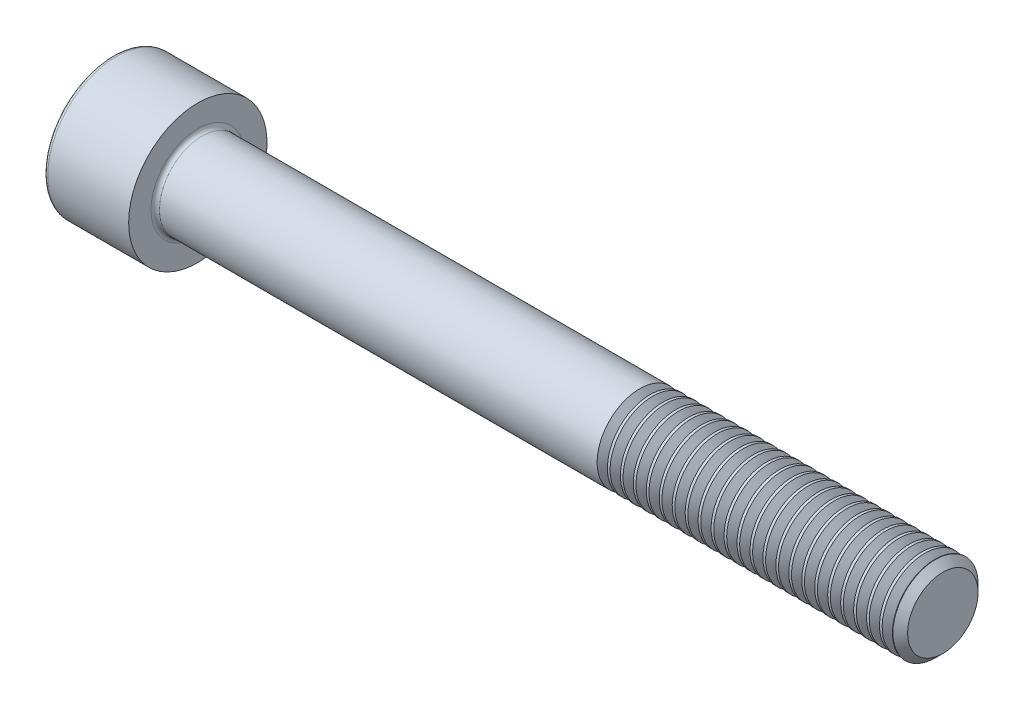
ISO-10303-21;
HEADER;
FILE_DESCRIPTION(('STEP AP214'),'2;1');
FILE_NAME('part.step','',(''),(''),'','','');
FILE_SCHEMA(('AUTOMOTIVE_DESIGN { 1 0 10303 214 1 1 1 1 }'));
ENDSEC;
DATA;
#1=APPLICATION_CONTEXT('core data for automotive mechanical design processes');
#2=APPLICATION_PROTOCOL_DEFINITION('international standard','automotive_design',2000,#1);
#3=PRODUCT_CONTEXT('',#1,'mechanical');
#4=PRODUCT('Part','Part','',(#3));
#5=PRODUCT_RELATED_PRODUCT_CATEGORY('part','',(#4));
#6=PRODUCT_DEFINITION_FORMATION('','',#4);
#7=PRODUCT_DEFINITION_CONTEXT('part definition',#1,'design');
#8=PRODUCT_DEFINITION('design','',#6,#7);
#9=PRODUCT_DEFINITION_SHAPE('','',#8);
#10=(LENGTH_UNIT() NAMED_UNIT(*) SI_UNIT(.MILLI.,.METRE.));
#11=(NAMED_UNIT(*) PLANE_ANGLE_UNIT() SI_UNIT($,.RADIAN.));
#12=(NAMED_UNIT(*) SI_UNIT($,.STERADIAN.) SOLID_ANGLE_UNIT());
#13=UNCERTAINTY_MEASURE_WITH_UNIT(LENGTH_MEASURE(1.E-05),#10,'distance_accuracy_value','');
#14=(GEOMETRIC_REPRESENTATION_CONTEXT(3) GLOBAL_UNCERTAINTY_ASSIGNED_CONTEXT((#13)) GLOBAL_UNIT_ASSIGNED_CONTEXT((#10,
#11,#12)) REPRESENTATION_CONTEXT('',''));
#15=CARTESIAN_POINT('',(0.,0.,0.));
#16=DIRECTION('',(0.,0.,1.));
#17=DIRECTION('',(1.,0.,0.));
#18=AXIS2_PLACEMENT_3D('',#15,#16,#17);
#19=CARTESIAN_POINT('',(0.,0.,0.));
#20=DIRECTION('',(-1.,0.,0.));
#21=DIRECTION('',(0.,0.,1.));
#22=AXIS2_PLACEMENT_3D('',#19,#20,#21);
#23=PLANE('',#22);
#24=DIRECTION('',(0.,-0.499999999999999,0.866025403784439));
#25=VECTOR('',#24,1.);
#26=CARTESIAN_POINT('',(0.,3.51894989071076,0.));
#27=LINE('',#26,#25);
#28=CARTESIAN_POINT('',(0.,3.51894989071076,0.));
#29=VERTEX_POINT('',#28);
#30=CARTESIAN_POINT('',(0.,1.75947494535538,3.04749999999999));
#31=VERTEX_POINT('',#30);
#32=EDGE_CURVE('E110',#29,#31,#27,.T.);
#33=ORIENTED_EDGE('',*,*,#32,.T.);
#34=DIRECTION('',(0.,1.,0.));
#35=VECTOR('',#34,1.);
#36=CARTESIAN_POINT('',(0.,-1.75947494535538,3.0475));
#37=LINE('',#36,#35);
#38=CARTESIAN_POINT('',(0.,-1.75947494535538,3.0475));
#39=VERTEX_POINT('',#38);
#40=EDGE_CURVE('E99',#39,#31,#37,.T.);
#41=ORIENTED_EDGE('',*,*,#40,.F.);
#42=DIRECTION('',(0.,-0.500000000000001,-0.866025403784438));
#43=VECTOR('',#42,1.);
#44=CARTESIAN_POINT('',(0.,-1.75947494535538,3.0475));
#45=LINE('',#44,#43);
#46=CARTESIAN_POINT('',(0.,-3.51894989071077,0.));
#47=VERTEX_POINT('',#46);
#48=EDGE_CURVE('E109',#39,#47,#45,.T.);
#49=ORIENTED_EDGE('',*,*,#48,.T.);
#50=DIRECTION('',(0.,0.499999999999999,-0.866025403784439));
#51=VECTOR('',#50,1.);
#52=CARTESIAN_POINT('',(0.,-3.51894989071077,0.));
#53=LINE('',#52,#51);
#54=CARTESIAN_POINT('',(0.,-1.75947494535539,-3.0475));
#55=VERTEX_POINT('',#54);
#56=EDGE_CURVE('E133',#47,#55,#53,.T.);
#57=ORIENTED_EDGE('',*,*,#56,.T.);
#58=DIRECTION('',(0.,-1.,0.));
#59=VECTOR('',#58,1.);
#60=CARTESIAN_POINT('',(0.,1.75947494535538,-3.0475));
#61=LINE('',#60,#59);
#62=CARTESIAN_POINT('',(0.,1.75947494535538,-3.0475));
#63=VERTEX_POINT('',#62);
#64=EDGE_CURVE('E136',#63,#55,#61,.T.);
#65=ORIENTED_EDGE('',*,*,#64,.F.);
#66=DIRECTION('',(0.,-0.500000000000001,-0.866025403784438));
#67=VECTOR('',#66,1.);
#68=CARTESIAN_POINT('',(0.,3.51894989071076,0.));
#69=LINE('',#68,#67);
#70=EDGE_CURVE('E124',#29,#63,#69,.T.);
#71=ORIENTED_EDGE('',*,*,#70,.F.);
#72=EDGE_LOOP('',(#33,#41,#49,#57,#65,#71));
#73=FACE_BOUND('',#72,.T.);
#74=CARTESIAN_POINT('',(0.,0.,0.));
#75=DIRECTION('',(-1.,0.,0.));
#76=DIRECTION('',(0.,0.,1.));
#77=AXIS2_PLACEMENT_3D('',#74,#75,#76);
#78=CIRCLE('',#77,6.1);
#79=CARTESIAN_POINT('',(0.,0.,6.1));
#80=VERTEX_POINT('',#79);
#81=EDGE_CURVE('E35',#80,#80,#78,.T.);
#82=ORIENTED_EDGE('',*,*,#81,.T.);
#83=EDGE_LOOP('',(#82));
#84=FACE_BOUND('',#83,.T.);
#85=ADVANCED_FACE('F28',(#73,#84),#23,.T.);
#86=CARTESIAN_POINT('',(-31.75,0.,0.));
#87=DIRECTION('',(-1.,0.,0.));
#88=DIRECTION('',(0.,0.,1.));
#89=AXIS2_PLACEMENT_3D('',#86,#87,#88);
#90=CYLINDRICAL_SURFACE('',#89,6.5);
#91=CARTESIAN_POINT('',(0.399999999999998,0.,0.));
#92=DIRECTION('',(-1.,0.,0.));
#93=DIRECTION('',(0.,0.,1.));
#94=AXIS2_PLACEMENT_3D('',#91,#92,#93);
#95=CIRCLE('',#94,6.5);
#96=CARTESIAN_POINT('',(0.399999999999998,0.,6.5));
#97=VERTEX_POINT('',#96);
#98=EDGE_CURVE('E11',#97,#97,#95,.F.);
#99=ORIENTED_EDGE('',*,*,#98,.T.);
#100=EDGE_LOOP('',(#99));
#101=FACE_BOUND('',#100,.T.);
#102=CARTESIAN_POINT('',(8.,0.,0.));
#103=DIRECTION('',(-1.,0.,0.));
#104=DIRECTION('',(0.,0.,1.));
#105=AXIS2_PLACEMENT_3D('',#102,#103,#104);
#106=CIRCLE('',#105,6.5);
#107=CARTESIAN_POINT('',(8.,0.,6.5));
#108=VERTEX_POINT('',#107);
#109=EDGE_CURVE('E181',#108,#108,#106,.T.);
#110=ORIENTED_EDGE('',*,*,#109,.T.);
#111=EDGE_LOOP('',(#110));
#112=FACE_BOUND('',#111,.T.);
#113=ADVANCED_FACE('F208',(#101,#112),#90,.T.);
#114=CARTESIAN_POINT('',(8.,6.5,0.));
#115=DIRECTION('',(1.,0.,0.));
#116=DIRECTION('',(0.,0.,-1.));
#117=AXIS2_PLACEMENT_3D('',#114,#115,#116);
#118=PLANE('',#117);
#119=CARTESIAN_POINT('',(8.,0.,0.));
#120=DIRECTION('',(1.,0.,0.));
#121=DIRECTION('',(0.,0.,-1.));
#122=AXIS2_PLACEMENT_3D('',#119,#120,#121);
#123=CIRCLE('',#122,4.4);
#124=CARTESIAN_POINT('',(8.,0.,-4.4));
#125=VERTEX_POINT('',#124);
#126=EDGE_CURVE('E184',#125,#125,#123,.F.);
#127=ORIENTED_EDGE('',*,*,#126,.T.);
#128=EDGE_LOOP('',(#127));
#129=FACE_BOUND('',#128,.T.);
#130=ORIENTED_EDGE('',*,*,#109,.F.);
#131=EDGE_LOOP('',(#130));
#132=FACE_BOUND('',#131,.T.);
#133=ADVANCED_FACE('F212',(#129,#132),#118,.T.);
#134=CARTESIAN_POINT('',(-31.75,0.,0.));
#135=DIRECTION('',(-1.,0.,0.));
#136=DIRECTION('',(0.,0.,1.));
#137=AXIS2_PLACEMENT_3D('',#134,#135,#136);
#138=CYLINDRICAL_SURFACE('',#137,4.);
#139=CARTESIAN_POINT('',(49.5165066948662,0.,0.));
#140=DIRECTION('',(-1.,0.,0.));
#141=DIRECTION('',(0.,-1.,0.));
#142=AXIS2_PLACEMENT_3D('',#139,#140,#141);
#143=CIRCLE('',#142,4.00000000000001);
#144=CARTESIAN_POINT('',(49.5165066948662,-4.,0.));
#145=VERTEX_POINT('',#144);
#146=EDGE_CURVE('E128',#145,#145,#143,.T.);
#147=ORIENTED_EDGE('',*,*,#146,.T.);
#148=EDGE_LOOP('',(#147));
#149=FACE_BOUND('',#148,.T.);
#150=CARTESIAN_POINT('',(8.4,0.,0.));
#151=DIRECTION('',(1.,0.,0.));
#152=DIRECTION('',(0.,0.,-1.));
#153=AXIS2_PLACEMENT_3D('',#150,#151,#152);
#154=CIRCLE('',#153,4.);
#155=CARTESIAN_POINT('',(8.4,0.,-4.));
#156=VERTEX_POINT('',#155);
#157=EDGE_CURVE('E187',#156,#156,#154,.T.);
#158=ORIENTED_EDGE('',*,*,#157,.T.);
#159=EDGE_LOOP('',(#158));
#160=FACE_BOUND('',#159,.T.);
#161=ADVANCED_FACE('F202',(#149,#160),#138,.T.);
#162=CARTESIAN_POINT('',(8.4,0.,0.));
#163=DIRECTION('',(1.,0.,0.));
#164=DIRECTION('',(0.,0.,-1.));
#165=AXIS2_PLACEMENT_3D('',#162,#163,#164);
#166=TOROIDAL_SURFACE('',#165,4.4,0.4);
#167=ORIENTED_EDGE('',*,*,#157,.F.);
#168=EDGE_LOOP('',(#167));
#169=FACE_BOUND('',#168,.T.);
#170=ORIENTED_EDGE('',*,*,#126,.F.);
#171=EDGE_LOOP('',(#170));
#172=FACE_BOUND('',#171,.T.);
#173=ADVANCED_FACE('F194',(#169,#172),#166,.F.);
#174=CARTESIAN_POINT('',(0.399999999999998,0.,0.));
#175=DIRECTION('',(-1.,0.,0.));
#176=DIRECTION('',(0.,0.,1.));
#177=AXIS2_PLACEMENT_3D('',#174,#175,#176);
#178=TOROIDAL_SURFACE('',#177,6.1,0.4);
#179=ORIENTED_EDGE('',*,*,#98,.F.);
#180=EDGE_LOOP('',(#179));
#181=FACE_BOUND('',#180,.T.);
#182=ORIENTED_EDGE('',*,*,#81,.F.);
#183=EDGE_LOOP('',(#182));
#184=FACE_BOUND('',#183,.T.);
#185=ADVANCED_FACE('F192',(#181,#184),#178,.T.);
#186=CARTESIAN_POINT('',(4.,3.51894989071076,0.));
#187=DIRECTION('',(0.,-0.866025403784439,-0.499999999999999));
#188=DIRECTION('',(0.,0.499999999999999,-0.866025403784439));
#189=AXIS2_PLACEMENT_3D('',#186,#187,#188);
#190=PLANE('',#189);
#191=ORIENTED_EDGE('',*,*,#32,.F.);
#192=DIRECTION('',(-1.,0.,0.));
#193=VECTOR('',#192,1.);
#194=CARTESIAN_POINT('',(4.,3.51894989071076,0.));
#195=LINE('',#194,#193);
#196=CARTESIAN_POINT('',(4.,3.51894989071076,0.));
#197=VERTEX_POINT('',#196);
#198=EDGE_CURVE('E159',#197,#29,#195,.T.);
#199=ORIENTED_EDGE('',*,*,#198,.F.);
#200=DIRECTION('',(0.,-0.499999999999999,0.866025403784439));
#201=VECTOR('',#200,1.);
#202=CARTESIAN_POINT('',(4.,3.51894989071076,0.));
#203=LINE('',#202,#201);
#204=CARTESIAN_POINT('',(4.,2.63921241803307,1.52374999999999));
#205=VERTEX_POINT('',#204);
#206=EDGE_CURVE('E139',#197,#205,#203,.T.);
#207=ORIENTED_EDGE('',*,*,#206,.T.);
#208=CARTESIAN_POINT('',(4.,1.75947494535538,3.04749999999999));
#209=VERTEX_POINT('',#208);
#210=EDGE_CURVE('E118',#205,#209,#203,.T.);
#211=ORIENTED_EDGE('',*,*,#210,.T.);
#212=DIRECTION('',(-1.,0.,0.));
#213=VECTOR('',#212,1.);
#214=CARTESIAN_POINT('',(4.,1.75947494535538,3.04749999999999));
#215=LINE('',#214,#213);
#216=EDGE_CURVE('E103',#209,#31,#215,.T.);
#217=ORIENTED_EDGE('',*,*,#216,.T.);
#218=EDGE_LOOP('',(#191,#199,#207,#211,#217));
#219=FACE_BOUND('',#218,.T.);
#220=ADVANCED_FACE('F114',(#219),#190,.T.);
#221=CARTESIAN_POINT('',(4.,-1.75947494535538,3.0475));
#222=DIRECTION('',(0.,0.,1.));
#223=DIRECTION('',(0.,-1.,0.));
#224=AXIS2_PLACEMENT_3D('',#221,#222,#223);
#225=PLANE('',#224);
#226=ORIENTED_EDGE('',*,*,#40,.T.);
#227=ORIENTED_EDGE('',*,*,#216,.F.);
#228=DIRECTION('',(0.,1.,0.));
#229=VECTOR('',#228,1.);
#230=CARTESIAN_POINT('',(4.,-1.75947494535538,3.0475));
#231=LINE('',#230,#229);
#232=CARTESIAN_POINT('',(4.,0.,3.0475));
#233=VERTEX_POINT('',#232);
#234=EDGE_CURVE('E141',#233,#209,#231,.T.);
#235=ORIENTED_EDGE('',*,*,#234,.F.);
#236=CARTESIAN_POINT('',(4.,-1.75947494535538,3.0475));
#237=VERTEX_POINT('',#236);
#238=EDGE_CURVE('E142',#237,#233,#231,.T.);
#239=ORIENTED_EDGE('',*,*,#238,.F.);
#240=DIRECTION('',(-1.,0.,0.));
#241=VECTOR('',#240,1.);
#242=CARTESIAN_POINT('',(4.,-1.75947494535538,3.0475));
#243=LINE('',#242,#241);
#244=EDGE_CURVE('E105',#237,#39,#243,.T.);
#245=ORIENTED_EDGE('',*,*,#244,.T.);
#246=EDGE_LOOP('',(#226,#227,#235,#239,#245));
#247=FACE_BOUND('',#246,.T.);
#248=ADVANCED_FACE('F101',(#247),#225,.F.);
#249=CARTESIAN_POINT('',(4.,-1.75947494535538,3.0475));
#250=DIRECTION('',(0.,0.866025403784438,-0.500000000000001));
#251=DIRECTION('',(0.,0.500000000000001,0.866025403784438));
#252=AXIS2_PLACEMENT_3D('',#249,#250,#251);
#253=PLANE('',#252);
#254=ORIENTED_EDGE('',*,*,#48,.F.);
#255=ORIENTED_EDGE('',*,*,#244,.F.);
#256=DIRECTION('',(0.,-0.500000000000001,-0.866025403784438));
#257=VECTOR('',#256,1.);
#258=CARTESIAN_POINT('',(4.,-1.75947494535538,3.0475));
#259=LINE('',#258,#257);
#260=CARTESIAN_POINT('',(4.,-2.63921241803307,1.52375));
#261=VERTEX_POINT('',#260);
#262=EDGE_CURVE('E146',#237,#261,#259,.T.);
#263=ORIENTED_EDGE('',*,*,#262,.T.);
#264=CARTESIAN_POINT('',(4.,-3.51894989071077,0.));
#265=VERTEX_POINT('',#264);
#266=EDGE_CURVE('E145',#261,#265,#259,.T.);
#267=ORIENTED_EDGE('',*,*,#266,.T.);
#268=DIRECTION('',(-1.,0.,0.));
#269=VECTOR('',#268,1.);
#270=CARTESIAN_POINT('',(4.,-3.51894989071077,0.));
#271=LINE('',#270,#269);
#272=EDGE_CURVE('E167',#265,#47,#271,.T.);
#273=ORIENTED_EDGE('',*,*,#272,.T.);
#274=EDGE_LOOP('',(#254,#255,#263,#267,#273));
#275=FACE_BOUND('',#274,.T.);
#276=ADVANCED_FACE('F465',(#275),#253,.T.);
#277=CARTESIAN_POINT('',(4.,-3.51894989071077,0.));
#278=DIRECTION('',(0.,0.866025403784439,0.499999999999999));
#279=DIRECTION('',(0.,-0.499999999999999,0.866025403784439));
#280=AXIS2_PLACEMENT_3D('',#277,#278,#279);
#281=PLANE('',#280);
#282=ORIENTED_EDGE('',*,*,#56,.F.);
#283=ORIENTED_EDGE('',*,*,#272,.F.);
#284=DIRECTION('',(0.,0.499999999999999,-0.866025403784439));
#285=VECTOR('',#284,1.);
#286=CARTESIAN_POINT('',(4.,-3.51894989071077,0.));
#287=LINE('',#286,#285);
#288=CARTESIAN_POINT('',(4.,-2.63921241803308,-1.52375));
#289=VERTEX_POINT('',#288);
#290=EDGE_CURVE('E150',#265,#289,#287,.T.);
#291=ORIENTED_EDGE('',*,*,#290,.T.);
#292=CARTESIAN_POINT('',(4.,-1.75947494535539,-3.0475));
#293=VERTEX_POINT('',#292);
#294=EDGE_CURVE('E149',#289,#293,#287,.T.);
#295=ORIENTED_EDGE('',*,*,#294,.T.);
#296=DIRECTION('',(-1.,0.,0.));
#297=VECTOR('',#296,1.);
#298=CARTESIAN_POINT('',(4.,-1.75947494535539,-3.0475));
#299=LINE('',#298,#297);
#300=EDGE_CURVE('E164',#293,#55,#299,.T.);
#301=ORIENTED_EDGE('',*,*,#300,.T.);
#302=EDGE_LOOP('',(#282,#283,#291,#295,#301));
#303=FACE_BOUND('',#302,.T.);
#304=ADVANCED_FACE('F461',(#303),#281,.T.);
#305=CARTESIAN_POINT('',(4.,1.75947494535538,-3.0475));
#306=DIRECTION('',(0.,0.,-1.));
#307=DIRECTION('',(0.,1.,0.));
#308=AXIS2_PLACEMENT_3D('',#305,#306,#307);
#309=PLANE('',#308);
#310=ORIENTED_EDGE('',*,*,#64,.T.);
#311=ORIENTED_EDGE('',*,*,#300,.F.);
#312=DIRECTION('',(0.,-1.,0.));
#313=VECTOR('',#312,1.);
#314=CARTESIAN_POINT('',(4.,1.75947494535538,-3.0475));
#315=LINE('',#314,#313);
#316=CARTESIAN_POINT('',(4.,0.,-3.0475));
#317=VERTEX_POINT('',#316);
#318=EDGE_CURVE('E153',#317,#293,#315,.T.);
#319=ORIENTED_EDGE('',*,*,#318,.F.);
#320=CARTESIAN_POINT('',(4.,1.75947494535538,-3.0475));
#321=VERTEX_POINT('',#320);
#322=EDGE_CURVE('E42',#321,#317,#315,.T.);
#323=ORIENTED_EDGE('',*,*,#322,.F.);
#324=DIRECTION('',(-1.,0.,0.));
#325=VECTOR('',#324,1.);
#326=CARTESIAN_POINT('',(4.,1.75947494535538,-3.0475));
#327=LINE('',#326,#325);
#328=EDGE_CURVE('E161',#321,#63,#327,.T.);
#329=ORIENTED_EDGE('',*,*,#328,.T.);
#330=EDGE_LOOP('',(#310,#311,#319,#323,#329));
#331=FACE_BOUND('',#330,.T.);
#332=ADVANCED_FACE('F457',(#331),#309,.F.);
#333=CARTESIAN_POINT('',(4.,3.51894989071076,0.));
#334=DIRECTION('',(0.,0.866025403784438,-0.500000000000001));
#335=DIRECTION('',(0.,0.500000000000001,0.866025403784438));
#336=AXIS2_PLACEMENT_3D('',#333,#334,#335);
#337=PLANE('',#336);
#338=ORIENTED_EDGE('',*,*,#70,.T.);
#339=ORIENTED_EDGE('',*,*,#328,.F.);
#340=DIRECTION('',(0.,-0.500000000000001,-0.866025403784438));
#341=VECTOR('',#340,1.);
#342=CARTESIAN_POINT('',(4.,3.51894989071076,0.));
#343=LINE('',#342,#341);
#344=CARTESIAN_POINT('',(4.,2.63921241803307,-1.52375));
#345=VERTEX_POINT('',#344);
#346=EDGE_CURVE('E155',#345,#321,#343,.T.);
#347=ORIENTED_EDGE('',*,*,#346,.F.);
#348=EDGE_CURVE('E156',#197,#345,#343,.T.);
#349=ORIENTED_EDGE('',*,*,#348,.F.);
#350=ORIENTED_EDGE('',*,*,#198,.T.);
#351=EDGE_LOOP('',(#338,#339,#347,#349,#350));
#352=FACE_BOUND('',#351,.T.);
#353=ADVANCED_FACE('F452',(#352),#337,.F.);
#354=CARTESIAN_POINT('',(4.,5.27842483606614,-3.04750000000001));
#355=DIRECTION('',(1.,0.,0.));
#356=DIRECTION('',(0.,0.,-1.));
#357=AXIS2_PLACEMENT_3D('',#354,#355,#356);
#358=PLANE('',#357);
#359=ORIENTED_EDGE('',*,*,#318,.T.);
#360=ORIENTED_EDGE('',*,*,#294,.F.);
#361=CARTESIAN_POINT('',(4.,0.,0.));
#362=DIRECTION('',(-1.,0.,0.));
#363=DIRECTION('',(0.,0.,1.));
#364=AXIS2_PLACEMENT_3D('',#361,#362,#363);
#365=CIRCLE('',#364,3.0475);
#366=EDGE_CURVE('E491',#317,#289,#365,.T.);
#367=ORIENTED_EDGE('',*,*,#366,.F.);
#368=EDGE_LOOP('',(#359,#360,#367));
#369=FACE_BOUND('',#368,.T.);
#370=ADVANCED_FACE('F448',(#369),#358,.F.);
#371=ORIENTED_EDGE('',*,*,#290,.F.);
#372=ORIENTED_EDGE('',*,*,#266,.F.);
#373=EDGE_CURVE('E489',#289,#261,#365,.T.);
#374=ORIENTED_EDGE('',*,*,#373,.F.);
#375=EDGE_LOOP('',(#371,#372,#374));
#376=FACE_BOUND('',#375,.T.);
#377=ADVANCED_FACE('F451',(#376),#358,.F.);
#378=ORIENTED_EDGE('',*,*,#262,.F.);
#379=ORIENTED_EDGE('',*,*,#238,.T.);
#380=EDGE_CURVE('E119',#261,#233,#365,.T.);
#381=ORIENTED_EDGE('',*,*,#380,.F.);
#382=EDGE_LOOP('',(#378,#379,#381));
#383=FACE_BOUND('',#382,.T.);
#384=ADVANCED_FACE('F485',(#383),#358,.F.);
#385=ORIENTED_EDGE('',*,*,#234,.T.);
#386=ORIENTED_EDGE('',*,*,#210,.F.);
#387=EDGE_CURVE('E171',#233,#205,#365,.T.);
#388=ORIENTED_EDGE('',*,*,#387,.F.);
#389=EDGE_LOOP('',(#385,#386,#388));
#390=FACE_BOUND('',#389,.T.);
#391=ADVANCED_FACE('F482',(#390),#358,.F.);
#392=ORIENTED_EDGE('',*,*,#206,.F.);
#393=ORIENTED_EDGE('',*,*,#348,.T.);
#394=EDGE_CURVE('E175',#205,#345,#365,.T.);
#395=ORIENTED_EDGE('',*,*,#394,.F.);
#396=EDGE_LOOP('',(#392,#393,#395));
#397=FACE_BOUND('',#396,.T.);
#398=ADVANCED_FACE('F475',(#397),#358,.F.);
#399=ORIENTED_EDGE('',*,*,#346,.T.);
#400=ORIENTED_EDGE('',*,*,#322,.T.);
#401=EDGE_CURVE('E495',#345,#317,#365,.T.);
#402=ORIENTED_EDGE('',*,*,#401,.F.);
#403=EDGE_LOOP('',(#399,#400,#402));
#404=FACE_BOUND('',#403,.T.);
#405=ADVANCED_FACE('F454',(#404),#358,.F.);
#406=CARTESIAN_POINT('',(4.,0.,0.));
#407=DIRECTION('',(-1.,0.,0.));
#408=DIRECTION('',(0.,0.,1.));
#409=AXIS2_PLACEMENT_3D('',#406,#407,#408);
#410=CONICAL_SURFACE('',#409,3.0475,1.04719755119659);
#411=CARTESIAN_POINT('',(5.75947494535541,0.,0.));
#412=VERTEX_POINT('',#411);
#413=VERTEX_LOOP('',#412);
#414=FACE_BOUND('',#413,.T.);
#415=ORIENTED_EDGE('',*,*,#387,.T.);
#416=ORIENTED_EDGE('',*,*,#394,.T.);
#417=ORIENTED_EDGE('',*,*,#401,.T.);
#418=ORIENTED_EDGE('',*,*,#366,.T.);
#419=ORIENTED_EDGE('',*,*,#373,.T.);
#420=ORIENTED_EDGE('',*,*,#380,.T.);
#421=EDGE_LOOP('',(#415,#416,#417,#418,#419,#420));
#422=FACE_BOUND('',#421,.T.);
#423=ADVANCED_FACE('F446',(#414,#422),#410,.F.);
#424=CARTESIAN_POINT('',(50.4834933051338,0.,0.));
#425=DIRECTION('',(1.,0.,0.));
#426=DIRECTION('',(0.,1.,0.));
#427=AXIS2_PLACEMENT_3D('',#424,#425,#426);
#428=CONICAL_SURFACE('',#427,4.00000000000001,0.959931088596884);
#429=CARTESIAN_POINT('',(50.,0.,0.));
#430=DIRECTION('',(-1.,0.,0.));
#431=DIRECTION('',(0.,-1.,0.));
#432=AXIS2_PLACEMENT_3D('',#429,#430,#431);
#433=CIRCLE('',#432,3.30950000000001);
#434=CARTESIAN_POINT('',(50.,-3.3095,0.));
#435=VERTEX_POINT('',#434);
#436=EDGE_CURVE('E1283',#435,#435,#433,.T.);
#437=ORIENTED_EDGE('',*,*,#436,.F.);
#438=EDGE_LOOP('',(#437));
#439=FACE_BOUND('',#438,.T.);
#440=CARTESIAN_POINT('',(50.4834933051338,0.,0.));
#441=DIRECTION('',(-1.,0.,0.));
#442=DIRECTION('',(0.,-1.,0.));
#443=AXIS2_PLACEMENT_3D('',#440,#441,#442);
#444=CIRCLE('',#443,4.00000000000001);
#445=CARTESIAN_POINT('',(50.4834933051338,-4.,0.));
#446=VERTEX_POINT('',#445);
#447=EDGE_CURVE('E125',#446,#446,#444,.T.);
#448=ORIENTED_EDGE('',*,*,#447,.T.);
#449=EDGE_LOOP('',(#448));
#450=FACE_BOUND('',#449,.T.);
#451=ADVANCED_FACE('F442',(#439,#450),#428,.T.);
#452=CARTESIAN_POINT('',(50.,0.,0.));
#453=DIRECTION('',(-1.,0.,0.));
#454=DIRECTION('',(0.,-1.,0.));
#455=AXIS2_PLACEMENT_3D('',#452,#453,#454);
#456=CONICAL_SURFACE('',#455,3.30950000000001,0.959931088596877);
#457=ORIENTED_EDGE('',*,*,#146,.F.);
#458=EDGE_LOOP('',(#457));
#459=FACE_BOUND('',#458,.T.);
#460=ORIENTED_EDGE('',*,*,#436,.T.);
#461=EDGE_LOOP('',(#460));
#462=FACE_BOUND('',#461,.T.);
#463=ADVANCED_FACE('F439',(#459,#462),#456,.T.);
#464=CARTESIAN_POINT('',(50.733897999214,0.,0.));
#465=DIRECTION('',(-1.,0.,0.));
#466=DIRECTION('',(0.,-1.,0.));
#467=AXIS2_PLACEMENT_3D('',#464,#465,#466);
#468=CIRCLE('',#467,4.00000000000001);
#469=CARTESIAN_POINT('',(50.733897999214,-4.,0.));
#470=VERTEX_POINT('',#469);
#471=EDGE_CURVE('E1277',#470,#470,#468,.T.);
#472=ORIENTED_EDGE('',*,*,#471,.T.);
#473=EDGE_LOOP('',(#472));
#474=FACE_BOUND('',#473,.T.);
#475=ORIENTED_EDGE('',*,*,#447,.F.);
#476=EDGE_LOOP('',(#475));
#477=FACE_BOUND('',#476,.T.);
#478=ADVANCED_FACE('F225',(#474,#477),#138,.T.);
#479=CARTESIAN_POINT('',(51.7008846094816,0.,0.));
#480=DIRECTION('',(1.,0.,0.));
#481=DIRECTION('',(0.,1.,0.));
#482=AXIS2_PLACEMENT_3D('',#479,#480,#481);
#483=CONICAL_SURFACE('',#482,4.00000000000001,0.959931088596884);
#484=CARTESIAN_POINT('',(51.2173913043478,0.,0.));
#485=DIRECTION('',(-1.,0.,0.));
#486=DIRECTION('',(0.,-1.,0.));
#487=AXIS2_PLACEMENT_3D('',#484,#485,#486);
#488=CIRCLE('',#487,3.30950000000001);
#489=CARTESIAN_POINT('',(51.2173913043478,-3.3095,0.));
#490=VERTEX_POINT('',#489);
#491=EDGE_CURVE('E1274',#490,#490,#488,.T.);
#492=ORIENTED_EDGE('',*,*,#491,.F.);
#493=EDGE_LOOP('',(#492));
#494=FACE_BOUND('',#493,.T.);
#495=CARTESIAN_POINT('',(51.7008846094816,0.,0.));
#496=DIRECTION('',(-1.,0.,0.));
#497=DIRECTION('',(0.,-1.,0.));
#498=AXIS2_PLACEMENT_3D('',#495,#496,#497);
#499=CIRCLE('',#498,4.00000000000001);
#500=CARTESIAN_POINT('',(51.7008846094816,-4.,0.));
#501=VERTEX_POINT('',#500);
#502=EDGE_CURVE('E1280',#501,#501,#499,.T.);
#503=ORIENTED_EDGE('',*,*,#502,.T.);
#504=EDGE_LOOP('',(#503));
#505=FACE_BOUND('',#504,.T.);
#506=ADVANCED_FACE('F434',(#494,#505),#483,.T.);
#507=CARTESIAN_POINT('',(51.2173913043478,0.,0.));
#508=DIRECTION('',(-1.,0.,0.));
#509=DIRECTION('',(0.,-1.,0.));
#510=AXIS2_PLACEMENT_3D('',#507,#508,#509);
#511=CONICAL_SURFACE('',#510,3.30950000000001,0.959931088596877);
#512=ORIENTED_EDGE('',*,*,#471,.F.);
#513=EDGE_LOOP('',(#512));
#514=FACE_BOUND('',#513,.T.);
#515=ORIENTED_EDGE('',*,*,#491,.T.);
#516=EDGE_LOOP('',(#515));
#517=FACE_BOUND('',#516,.T.);
#518=ADVANCED_FACE('F431',(#514,#517),#511,.T.);
#519=CARTESIAN_POINT('',(51.9512893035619,0.,0.));
#520=DIRECTION('',(-1.,0.,0.));
#521=DIRECTION('',(0.,-1.,0.));
#522=AXIS2_PLACEMENT_3D('',#519,#520,#521);
#523=CIRCLE('',#522,4.00000000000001);
#524=CARTESIAN_POINT('',(51.9512893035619,-4.,0.));
#525=VERTEX_POINT('',#524);
#526=EDGE_CURVE('E1268',#525,#525,#523,.T.);
#527=ORIENTED_EDGE('',*,*,#526,.T.);
#528=EDGE_LOOP('',(#527));
#529=FACE_BOUND('',#528,.T.);
#530=ORIENTED_EDGE('',*,*,#502,.F.);
#531=EDGE_LOOP('',(#530));
#532=FACE_BOUND('',#531,.T.);
#533=ADVANCED_FACE('F429',(#529,#532),#138,.T.);
#534=CARTESIAN_POINT('',(52.9182759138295,0.,0.));
#535=DIRECTION('',(1.,0.,0.));
#536=DIRECTION('',(0.,1.,0.));
#537=AXIS2_PLACEMENT_3D('',#534,#535,#536);
#538=CONICAL_SURFACE('',#537,4.00000000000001,0.959931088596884);
#539=CARTESIAN_POINT('',(52.4347826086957,0.,0.));
#540=DIRECTION('',(-1.,0.,0.));
#541=DIRECTION('',(0.,-1.,0.));
#542=AXIS2_PLACEMENT_3D('',#539,#540,#541);
#543=CIRCLE('',#542,3.30950000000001);
#544=CARTESIAN_POINT('',(52.4347826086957,-3.3095,0.));
#545=VERTEX_POINT('',#544);
#546=EDGE_CURVE('E1265',#545,#545,#543,.T.);
#547=ORIENTED_EDGE('',*,*,#546,.F.);
#548=EDGE_LOOP('',(#547));
#549=FACE_BOUND('',#548,.T.);
#550=CARTESIAN_POINT('',(52.9182759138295,0.,0.));
#551=DIRECTION('',(-1.,0.,0.));
#552=DIRECTION('',(0.,-1.,0.));
#553=AXIS2_PLACEMENT_3D('',#550,#551,#552);
#554=CIRCLE('',#553,4.00000000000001);
#555=CARTESIAN_POINT('',(52.9182759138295,-4.,0.));
#556=VERTEX_POINT('',#555);
#557=EDGE_CURVE('E1271',#556,#556,#554,.T.);
#558=ORIENTED_EDGE('',*,*,#557,.T.);
#559=EDGE_LOOP('',(#558));
#560=FACE_BOUND('',#559,.T.);
#561=ADVANCED_FACE('F425',(#549,#560),#538,.T.);
#562=CARTESIAN_POINT('',(52.4347826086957,0.,0.));
#563=DIRECTION('',(-1.,0.,0.));
#564=DIRECTION('',(0.,-1.,0.));
#565=AXIS2_PLACEMENT_3D('',#562,#563,#564);
#566=CONICAL_SURFACE('',#565,3.30950000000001,0.959931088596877);
#567=ORIENTED_EDGE('',*,*,#526,.F.);
#568=EDGE_LOOP('',(#567));
#569=FACE_BOUND('',#568,.T.);
#570=ORIENTED_EDGE('',*,*,#546,.T.);
#571=EDGE_LOOP('',(#570));
#572=FACE_BOUND('',#571,.T.);
#573=ADVANCED_FACE('F422',(#569,#572),#566,.T.);
#574=CARTESIAN_POINT('',(53.1686806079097,0.,0.));
#575=DIRECTION('',(-1.,0.,0.));
#576=DIRECTION('',(0.,-1.,0.));
#577=AXIS2_PLACEMENT_3D('',#574,#575,#576);
#578=CIRCLE('',#577,4.00000000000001);
#579=CARTESIAN_POINT('',(53.1686806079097,-4.,0.));
#580=VERTEX_POINT('',#579);
#581=EDGE_CURVE('E1259',#580,#580,#578,.T.);
#582=ORIENTED_EDGE('',*,*,#581,.T.);
#583=EDGE_LOOP('',(#582));
#584=FACE_BOUND('',#583,.T.);
#585=ORIENTED_EDGE('',*,*,#557,.F.);
#586=EDGE_LOOP('',(#585));
#587=FACE_BOUND('',#586,.T.);
#588=ADVANCED_FACE('F420',(#584,#587),#138,.T.);
#589=CARTESIAN_POINT('',(54.1356672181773,0.,0.));
#590=DIRECTION('',(1.,0.,0.));
#591=DIRECTION('',(0.,1.,0.));
#592=AXIS2_PLACEMENT_3D('',#589,#590,#591);
#593=CONICAL_SURFACE('',#592,4.00000000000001,0.959931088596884);
#594=CARTESIAN_POINT('',(53.6521739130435,0.,0.));
#595=DIRECTION('',(-1.,0.,0.));
#596=DIRECTION('',(0.,-1.,0.));
#597=AXIS2_PLACEMENT_3D('',#594,#595,#596);
#598=CIRCLE('',#597,3.30950000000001);
#599=CARTESIAN_POINT('',(53.6521739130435,-3.3095,0.));
#600=VERTEX_POINT('',#599);
#601=EDGE_CURVE('E1256',#600,#600,#598,.T.);
#602=ORIENTED_EDGE('',*,*,#601,.F.);
#603=EDGE_LOOP('',(#602));
#604=FACE_BOUND('',#603,.T.);
#605=CARTESIAN_POINT('',(54.1356672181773,0.,0.));
#606=DIRECTION('',(-1.,0.,0.));
#607=DIRECTION('',(0.,-1.,0.));
#608=AXIS2_PLACEMENT_3D('',#605,#606,#607);
#609=CIRCLE('',#608,4.00000000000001);
#610=CARTESIAN_POINT('',(54.1356672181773,-4.,0.));
#611=VERTEX_POINT('',#610);
#612=EDGE_CURVE('E1262',#611,#611,#609,.T.);
#613=ORIENTED_EDGE('',*,*,#612,.T.);
#614=EDGE_LOOP('',(#613));
#615=FACE_BOUND('',#614,.T.);
#616=ADVANCED_FACE('F416',(#604,#615),#593,.T.);
#617=CARTESIAN_POINT('',(53.6521739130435,0.,0.));
#618=DIRECTION('',(-1.,0.,0.));
#619=DIRECTION('',(0.,-1.,0.));
#620=AXIS2_PLACEMENT_3D('',#617,#618,#619);
#621=CONICAL_SURFACE('',#620,3.30950000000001,0.959931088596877);
#622=ORIENTED_EDGE('',*,*,#581,.F.);
#623=EDGE_LOOP('',(#622));
#624=FACE_BOUND('',#623,.T.);
#625=ORIENTED_EDGE('',*,*,#601,.T.);
#626=EDGE_LOOP('',(#625));
#627=FACE_BOUND('',#626,.T.);
#628=ADVANCED_FACE('F413',(#624,#627),#621,.T.);
#629=CARTESIAN_POINT('',(54.3860719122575,0.,0.));
#630=DIRECTION('',(-1.,0.,0.));
#631=DIRECTION('',(0.,-1.,0.));
#632=AXIS2_PLACEMENT_3D('',#629,#630,#631);
#633=CIRCLE('',#632,4.00000000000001);
#634=CARTESIAN_POINT('',(54.3860719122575,-4.,0.));
#635=VERTEX_POINT('',#634);
#636=EDGE_CURVE('E1250',#635,#635,#633,.T.);
#637=ORIENTED_EDGE('',*,*,#636,.T.);
#638=EDGE_LOOP('',(#637));
#639=FACE_BOUND('',#638,.T.);
#640=ORIENTED_EDGE('',*,*,#612,.F.);
#641=EDGE_LOOP('',(#640));
#642=FACE_BOUND('',#641,.T.);
#643=ADVANCED_FACE('F411',(#639,#642),#138,.T.);
#644=CARTESIAN_POINT('',(55.3530585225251,0.,0.));
#645=DIRECTION('',(1.,0.,0.));
#646=DIRECTION('',(0.,1.,0.));
#647=AXIS2_PLACEMENT_3D('',#644,#645,#646);
#648=CONICAL_SURFACE('',#647,4.00000000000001,0.959931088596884);
#649=CARTESIAN_POINT('',(54.8695652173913,0.,0.));
#650=DIRECTION('',(-1.,0.,0.));
#651=DIRECTION('',(0.,-1.,0.));
#652=AXIS2_PLACEMENT_3D('',#649,#650,#651);
#653=CIRCLE('',#652,3.30950000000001);
#654=CARTESIAN_POINT('',(54.8695652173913,-3.3095,0.));
#655=VERTEX_POINT('',#654);
#656=EDGE_CURVE('E1247',#655,#655,#653,.T.);
#657=ORIENTED_EDGE('',*,*,#656,.F.);
#658=EDGE_LOOP('',(#657));
#659=FACE_BOUND('',#658,.T.);
#660=CARTESIAN_POINT('',(55.3530585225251,0.,0.));
#661=DIRECTION('',(-1.,0.,0.));
#662=DIRECTION('',(0.,-1.,0.));
#663=AXIS2_PLACEMENT_3D('',#660,#661,#662);
#664=CIRCLE('',#663,4.00000000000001);
#665=CARTESIAN_POINT('',(55.3530585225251,-4.,0.));
#666=VERTEX_POINT('',#665);
#667=EDGE_CURVE('E1253',#666,#666,#664,.T.);
#668=ORIENTED_EDGE('',*,*,#667,.T.);
#669=EDGE_LOOP('',(#668));
#670=FACE_BOUND('',#669,.T.);
#671=ADVANCED_FACE('F407',(#659,#670),#648,.T.);
#672=CARTESIAN_POINT('',(54.8695652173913,0.,0.));
#673=DIRECTION('',(-1.,0.,0.));
#674=DIRECTION('',(0.,-1.,0.));
#675=AXIS2_PLACEMENT_3D('',#672,#673,#674);
#676=CONICAL_SURFACE('',#675,3.30950000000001,0.959931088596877);
#677=ORIENTED_EDGE('',*,*,#636,.F.);
#678=EDGE_LOOP('',(#677));
#679=FACE_BOUND('',#678,.T.);
#680=ORIENTED_EDGE('',*,*,#656,.T.);
#681=EDGE_LOOP('',(#680));
#682=FACE_BOUND('',#681,.T.);
#683=ADVANCED_FACE('F404',(#679,#682),#676,.T.);
#684=CARTESIAN_POINT('',(55.6034632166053,0.,0.));
#685=DIRECTION('',(-1.,0.,0.));
#686=DIRECTION('',(0.,-1.,0.));
#687=AXIS2_PLACEMENT_3D('',#684,#685,#686);
#688=CIRCLE('',#687,4.00000000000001);
#689=CARTESIAN_POINT('',(55.6034632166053,-4.,0.));
#690=VERTEX_POINT('',#689);
#691=EDGE_CURVE('E1241',#690,#690,#688,.T.);
#692=ORIENTED_EDGE('',*,*,#691,.T.);
#693=EDGE_LOOP('',(#692));
#694=FACE_BOUND('',#693,.T.);
#695=ORIENTED_EDGE('',*,*,#667,.F.);
#696=EDGE_LOOP('',(#695));
#697=FACE_BOUND('',#696,.T.);
#698=ADVANCED_FACE('F402',(#694,#697),#138,.T.);
#699=CARTESIAN_POINT('',(56.5704498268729,0.,0.));
#700=DIRECTION('',(1.,0.,0.));
#701=DIRECTION('',(0.,1.,0.));
#702=AXIS2_PLACEMENT_3D('',#699,#700,#701);
#703=CONICAL_SURFACE('',#702,4.00000000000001,0.959931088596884);
#704=CARTESIAN_POINT('',(56.0869565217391,0.,0.));
#705=DIRECTION('',(-1.,0.,0.));
#706=DIRECTION('',(0.,-1.,0.));
#707=AXIS2_PLACEMENT_3D('',#704,#705,#706);
#708=CIRCLE('',#707,3.30950000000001);
#709=CARTESIAN_POINT('',(56.0869565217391,-3.3095,0.));
#710=VERTEX_POINT('',#709);
#711=EDGE_CURVE('E1238',#710,#710,#708,.T.);
#712=ORIENTED_EDGE('',*,*,#711,.F.);
#713=EDGE_LOOP('',(#712));
#714=FACE_BOUND('',#713,.T.);
#715=CARTESIAN_POINT('',(56.5704498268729,0.,0.));
#716=DIRECTION('',(-1.,0.,0.));
#717=DIRECTION('',(0.,-1.,0.));
#718=AXIS2_PLACEMENT_3D('',#715,#716,#717);
#719=CIRCLE('',#718,4.00000000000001);
#720=CARTESIAN_POINT('',(56.5704498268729,-4.,0.));
#721=VERTEX_POINT('',#720);
#722=EDGE_CURVE('E1244',#721,#721,#719,.T.);
#723=ORIENTED_EDGE('',*,*,#722,.T.);
#724=EDGE_LOOP('',(#723));
#725=FACE_BOUND('',#724,.T.);
#726=ADVANCED_FACE('F398',(#714,#725),#703,.T.);
#727=CARTESIAN_POINT('',(56.0869565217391,0.,0.));
#728=DIRECTION('',(-1.,0.,0.));
#729=DIRECTION('',(0.,-1.,0.));
#730=AXIS2_PLACEMENT_3D('',#727,#728,#729);
#731=CONICAL_SURFACE('',#730,3.30950000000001,0.959931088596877);
#732=ORIENTED_EDGE('',*,*,#691,.F.);
#733=EDGE_LOOP('',(#732));
#734=FACE_BOUND('',#733,.T.);
#735=ORIENTED_EDGE('',*,*,#711,.T.);
#736=EDGE_LOOP('',(#735));
#737=FACE_BOUND('',#736,.T.);
#738=ADVANCED_FACE('F395',(#734,#737),#731,.T.);
#739=CARTESIAN_POINT('',(56.8208545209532,0.,0.));
#740=DIRECTION('',(-1.,0.,0.));
#741=DIRECTION('',(0.,-1.,0.));
#742=AXIS2_PLACEMENT_3D('',#739,#740,#741);
#743=CIRCLE('',#742,4.00000000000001);
#744=CARTESIAN_POINT('',(56.8208545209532,-4.,0.));
#745=VERTEX_POINT('',#744);
#746=EDGE_CURVE('E1232',#745,#745,#743,.T.);
#747=ORIENTED_EDGE('',*,*,#746,.T.);
#748=EDGE_LOOP('',(#747));
#749=FACE_BOUND('',#748,.T.);
#750=ORIENTED_EDGE('',*,*,#722,.F.);
#751=EDGE_LOOP('',(#750));
#752=FACE_BOUND('',#751,.T.);
#753=ADVANCED_FACE('F393',(#749,#752),#138,.T.);
#754=CARTESIAN_POINT('',(57.7878411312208,0.,0.));
#755=DIRECTION('',(1.,0.,0.));
#756=DIRECTION('',(0.,1.,0.));
#757=AXIS2_PLACEMENT_3D('',#754,#755,#756);
#758=CONICAL_SURFACE('',#757,4.00000000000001,0.959931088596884);
#759=CARTESIAN_POINT('',(57.304347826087,0.,0.));
#760=DIRECTION('',(-1.,0.,0.));
#761=DIRECTION('',(0.,-1.,0.));
#762=AXIS2_PLACEMENT_3D('',#759,#760,#761);
#763=CIRCLE('',#762,3.30950000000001);
#764=CARTESIAN_POINT('',(57.304347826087,-3.3095,0.));
#765=VERTEX_POINT('',#764);
#766=EDGE_CURVE('E1229',#765,#765,#763,.T.);
#767=ORIENTED_EDGE('',*,*,#766,.F.);
#768=EDGE_LOOP('',(#767));
#769=FACE_BOUND('',#768,.T.);
#770=CARTESIAN_POINT('',(57.7878411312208,0.,0.));
#771=DIRECTION('',(-1.,0.,0.));
#772=DIRECTION('',(0.,-1.,0.));
#773=AXIS2_PLACEMENT_3D('',#770,#771,#772);
#774=CIRCLE('',#773,4.00000000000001);
#775=CARTESIAN_POINT('',(57.7878411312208,-4.,0.));
#776=VERTEX_POINT('',#775);
#777=EDGE_CURVE('E1235',#776,#776,#774,.T.);
#778=ORIENTED_EDGE('',*,*,#777,.T.);
#779=EDGE_LOOP('',(#778));
#780=FACE_BOUND('',#779,.T.);
#781=ADVANCED_FACE('F389',(#769,#780),#758,.T.);
#782=CARTESIAN_POINT('',(57.304347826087,0.,0.));
#783=DIRECTION('',(-1.,0.,0.));
#784=DIRECTION('',(0.,-1.,0.));
#785=AXIS2_PLACEMENT_3D('',#782,#783,#784);
#786=CONICAL_SURFACE('',#785,3.30950000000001,0.959931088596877);
#787=ORIENTED_EDGE('',*,*,#746,.F.);
#788=EDGE_LOOP('',(#787));
#789=FACE_BOUND('',#788,.T.);
#790=ORIENTED_EDGE('',*,*,#766,.T.);
#791=EDGE_LOOP('',(#790));
#792=FACE_BOUND('',#791,.T.);
#793=ADVANCED_FACE('F386',(#789,#792),#786,.T.);
#794=CARTESIAN_POINT('',(58.038245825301,0.,0.));
#795=DIRECTION('',(-1.,0.,0.));
#796=DIRECTION('',(0.,-1.,0.));
#797=AXIS2_PLACEMENT_3D('',#794,#795,#796);
#798=CIRCLE('',#797,4.00000000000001);
#799=CARTESIAN_POINT('',(58.038245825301,-4.,0.));
#800=VERTEX_POINT('',#799);
#801=EDGE_CURVE('E1223',#800,#800,#798,.T.);
#802=ORIENTED_EDGE('',*,*,#801,.T.);
#803=EDGE_LOOP('',(#802));
#804=FACE_BOUND('',#803,.T.);
#805=ORIENTED_EDGE('',*,*,#777,.F.);
#806=EDGE_LOOP('',(#805));
#807=FACE_BOUND('',#806,.T.);
#808=ADVANCED_FACE('F384',(#804,#807),#138,.T.);
#809=CARTESIAN_POINT('',(59.0052324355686,0.,0.));
#810=DIRECTION('',(1.,0.,0.));
#811=DIRECTION('',(0.,1.,0.));
#812=AXIS2_PLACEMENT_3D('',#809,#810,#811);
#813=CONICAL_SURFACE('',#812,4.00000000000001,0.959931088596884);
#814=CARTESIAN_POINT('',(58.5217391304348,0.,0.));
#815=DIRECTION('',(-1.,0.,0.));
#816=DIRECTION('',(0.,-1.,0.));
#817=AXIS2_PLACEMENT_3D('',#814,#815,#816);
#818=CIRCLE('',#817,3.30950000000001);
#819=CARTESIAN_POINT('',(58.5217391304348,-3.3095,0.));
#820=VERTEX_POINT('',#819);
#821=EDGE_CURVE('E1220',#820,#820,#818,.T.);
#822=ORIENTED_EDGE('',*,*,#821,.F.);
#823=EDGE_LOOP('',(#822));
#824=FACE_BOUND('',#823,.T.);
#825=CARTESIAN_POINT('',(59.0052324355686,0.,0.));
#826=DIRECTION('',(-1.,0.,0.));
#827=DIRECTION('',(0.,-1.,0.));
#828=AXIS2_PLACEMENT_3D('',#825,#826,#827);
#829=CIRCLE('',#828,4.00000000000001);
#830=CARTESIAN_POINT('',(59.0052324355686,-4.,0.));
#831=VERTEX_POINT('',#830);
#832=EDGE_CURVE('E1226',#831,#831,#829,.T.);
#833=ORIENTED_EDGE('',*,*,#832,.T.);
#834=EDGE_LOOP('',(#833));
#835=FACE_BOUND('',#834,.T.);
#836=ADVANCED_FACE('F380',(#824,#835),#813,.T.);
#837=CARTESIAN_POINT('',(58.5217391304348,0.,0.));
#838=DIRECTION('',(-1.,0.,0.));
#839=DIRECTION('',(0.,-1.,0.));
#840=AXIS2_PLACEMENT_3D('',#837,#838,#839);
#841=CONICAL_SURFACE('',#840,3.30950000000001,0.959931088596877);
#842=ORIENTED_EDGE('',*,*,#801,.F.);
#843=EDGE_LOOP('',(#842));
#844=FACE_BOUND('',#843,.T.);
#845=ORIENTED_EDGE('',*,*,#821,.T.);
#846=EDGE_LOOP('',(#845));
#847=FACE_BOUND('',#846,.T.);
#848=ADVANCED_FACE('F377',(#844,#847),#841,.T.);
#849=CARTESIAN_POINT('',(59.2556371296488,0.,0.));
#850=DIRECTION('',(-1.,0.,0.));
#851=DIRECTION('',(0.,-1.,0.));
#852=AXIS2_PLACEMENT_3D('',#849,#850,#851);
#853=CIRCLE('',#852,4.00000000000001);
#854=CARTESIAN_POINT('',(59.2556371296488,-4.,0.));
#855=VERTEX_POINT('',#854);
#856=EDGE_CURVE('E1214',#855,#855,#853,.T.);
#857=ORIENTED_EDGE('',*,*,#856,.T.);
#858=EDGE_LOOP('',(#857));
#859=FACE_BOUND('',#858,.T.);
#860=ORIENTED_EDGE('',*,*,#832,.F.);
#861=EDGE_LOOP('',(#860));
#862=FACE_BOUND('',#861,.T.);
#863=ADVANCED_FACE('F375',(#859,#862),#138,.T.);
#864=CARTESIAN_POINT('',(60.2226237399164,0.,0.));
#865=DIRECTION('',(1.,0.,0.));
#866=DIRECTION('',(0.,1.,0.));
#867=AXIS2_PLACEMENT_3D('',#864,#865,#866);
#868=CONICAL_SURFACE('',#867,4.00000000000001,0.959931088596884);
#869=CARTESIAN_POINT('',(59.7391304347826,0.,0.));
#870=DIRECTION('',(-1.,0.,0.));
#871=DIRECTION('',(0.,-1.,0.));
#872=AXIS2_PLACEMENT_3D('',#869,#870,#871);
#873=CIRCLE('',#872,3.30950000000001);
#874=CARTESIAN_POINT('',(59.7391304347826,-3.3095,0.));
#875=VERTEX_POINT('',#874);
#876=EDGE_CURVE('E1211',#875,#875,#873,.T.);
#877=ORIENTED_EDGE('',*,*,#876,.F.);
#878=EDGE_LOOP('',(#877));
#879=FACE_BOUND('',#878,.T.);
#880=CARTESIAN_POINT('',(60.2226237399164,0.,0.));
#881=DIRECTION('',(-1.,0.,0.));
#882=DIRECTION('',(0.,-1.,0.));
#883=AXIS2_PLACEMENT_3D('',#880,#881,#882);
#884=CIRCLE('',#883,4.00000000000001);
#885=CARTESIAN_POINT('',(60.2226237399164,-4.,0.));
#886=VERTEX_POINT('',#885);
#887=EDGE_CURVE('E1217',#886,#886,#884,.T.);
#888=ORIENTED_EDGE('',*,*,#887,.T.);
#889=EDGE_LOOP('',(#888));
#890=FACE_BOUND('',#889,.T.);
#891=ADVANCED_FACE('F371',(#879,#890),#868,.T.);
#892=CARTESIAN_POINT('',(59.7391304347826,0.,0.));
#893=DIRECTION('',(-1.,0.,0.));
#894=DIRECTION('',(0.,-1.,0.));
#895=AXIS2_PLACEMENT_3D('',#892,#893,#894);
#896=CONICAL_SURFACE('',#895,3.30950000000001,0.959931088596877);
#897=ORIENTED_EDGE('',*,*,#856,.F.);
#898=EDGE_LOOP('',(#897));
#899=FACE_BOUND('',#898,.T.);
#900=ORIENTED_EDGE('',*,*,#876,.T.);
#901=EDGE_LOOP('',(#900));
#902=FACE_BOUND('',#901,.T.);
#903=ADVANCED_FACE('F368',(#899,#902),#896,.T.);
#904=CARTESIAN_POINT('',(60.4730284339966,0.,0.));
#905=DIRECTION('',(-1.,0.,0.));
#906=DIRECTION('',(0.,-1.,0.));
#907=AXIS2_PLACEMENT_3D('',#904,#905,#906);
#908=CIRCLE('',#907,4.00000000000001);
#909=CARTESIAN_POINT('',(60.4730284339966,-4.,0.));
#910=VERTEX_POINT('',#909);
#911=EDGE_CURVE('E1205',#910,#910,#908,.T.);
#912=ORIENTED_EDGE('',*,*,#911,.T.);
#913=EDGE_LOOP('',(#912));
#914=FACE_BOUND('',#913,.T.);
#915=ORIENTED_EDGE('',*,*,#887,.F.);
#916=EDGE_LOOP('',(#915));
#917=FACE_BOUND('',#916,.T.);
#918=ADVANCED_FACE('F366',(#914,#917),#138,.T.);
#919=CARTESIAN_POINT('',(61.4400150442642,0.,0.));
#920=DIRECTION('',(1.,0.,0.));
#921=DIRECTION('',(0.,1.,0.));
#922=AXIS2_PLACEMENT_3D('',#919,#920,#921);
#923=CONICAL_SURFACE('',#922,4.00000000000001,0.959931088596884);
#924=CARTESIAN_POINT('',(60.9565217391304,0.,0.));
#925=DIRECTION('',(-1.,0.,0.));
#926=DIRECTION('',(0.,-1.,0.));
#927=AXIS2_PLACEMENT_3D('',#924,#925,#926);
#928=CIRCLE('',#927,3.30950000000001);
#929=CARTESIAN_POINT('',(60.9565217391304,-3.3095,0.));
#930=VERTEX_POINT('',#929);
#931=EDGE_CURVE('E1202',#930,#930,#928,.T.);
#932=ORIENTED_EDGE('',*,*,#931,.F.);
#933=EDGE_LOOP('',(#932));
#934=FACE_BOUND('',#933,.T.);
#935=CARTESIAN_POINT('',(61.4400150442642,0.,0.));
#936=DIRECTION('',(-1.,0.,0.));
#937=DIRECTION('',(0.,-1.,0.));
#938=AXIS2_PLACEMENT_3D('',#935,#936,#937);
#939=CIRCLE('',#938,4.00000000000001);
#940=CARTESIAN_POINT('',(61.4400150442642,-4.,0.));
#941=VERTEX_POINT('',#940);
#942=EDGE_CURVE('E1208',#941,#941,#939,.T.);
#943=ORIENTED_EDGE('',*,*,#942,.T.);
#944=EDGE_LOOP('',(#943));
#945=FACE_BOUND('',#944,.T.);
#946=ADVANCED_FACE('F362',(#934,#945),#923,.T.);
#947=CARTESIAN_POINT('',(60.9565217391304,0.,0.));
#948=DIRECTION('',(-1.,0.,0.));
#949=DIRECTION('',(0.,-1.,0.));
#950=AXIS2_PLACEMENT_3D('',#947,#948,#949);
#951=CONICAL_SURFACE('',#950,3.30950000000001,0.959931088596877);
#952=ORIENTED_EDGE('',*,*,#911,.F.);
#953=EDGE_LOOP('',(#952));
#954=FACE_BOUND('',#953,.T.);
#955=ORIENTED_EDGE('',*,*,#931,.T.);
#956=EDGE_LOOP('',(#955));
#957=FACE_BOUND('',#956,.T.);
#958=ADVANCED_FACE('F359',(#954,#957),#951,.T.);
#959=CARTESIAN_POINT('',(61.6904197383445,0.,0.));
#960=DIRECTION('',(-1.,0.,0.));
#961=DIRECTION('',(0.,-1.,0.));
#962=AXIS2_PLACEMENT_3D('',#959,#960,#961);
#963=CIRCLE('',#962,4.00000000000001);
#964=CARTESIAN_POINT('',(61.6904197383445,-4.,0.));
#965=VERTEX_POINT('',#964);
#966=EDGE_CURVE('E1196',#965,#965,#963,.T.);
#967=ORIENTED_EDGE('',*,*,#966,.T.);
#968=EDGE_LOOP('',(#967));
#969=FACE_BOUND('',#968,.T.);
#970=ORIENTED_EDGE('',*,*,#942,.F.);
#971=EDGE_LOOP('',(#970));
#972=FACE_BOUND('',#971,.T.);
#973=ADVANCED_FACE('F357',(#969,#972),#138,.T.);
#974=CARTESIAN_POINT('',(62.6574063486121,0.,0.));
#975=DIRECTION('',(1.,0.,0.));
#976=DIRECTION('',(0.,1.,0.));
#977=AXIS2_PLACEMENT_3D('',#974,#975,#976);
#978=CONICAL_SURFACE('',#977,4.00000000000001,0.959931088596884);
#979=CARTESIAN_POINT('',(62.1739130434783,0.,0.));
#980=DIRECTION('',(-1.,0.,0.));
#981=DIRECTION('',(0.,-1.,0.));
#982=AXIS2_PLACEMENT_3D('',#979,#980,#981);
#983=CIRCLE('',#982,3.30950000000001);
#984=CARTESIAN_POINT('',(62.1739130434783,-3.3095,0.));
#985=VERTEX_POINT('',#984);
#986=EDGE_CURVE('E1193',#985,#985,#983,.T.);
#987=ORIENTED_EDGE('',*,*,#986,.F.);
#988=EDGE_LOOP('',(#987));
#989=FACE_BOUND('',#988,.T.);
#990=CARTESIAN_POINT('',(62.6574063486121,0.,0.));
#991=DIRECTION('',(-1.,0.,0.));
#992=DIRECTION('',(0.,-1.,0.));
#993=AXIS2_PLACEMENT_3D('',#990,#991,#992);
#994=CIRCLE('',#993,4.00000000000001);
#995=CARTESIAN_POINT('',(62.6574063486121,-4.,0.));
#996=VERTEX_POINT('',#995);
#997=EDGE_CURVE('E1199',#996,#996,#994,.T.);
#998=ORIENTED_EDGE('',*,*,#997,.T.);
#999=EDGE_LOOP('',(#998));
#1000=FACE_BOUND('',#999,.T.);
#1001=ADVANCED_FACE('F353',(#989,#1000),#978,.T.);
#1002=CARTESIAN_POINT('',(62.1739130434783,0.,0.));
#1003=DIRECTION('',(-1.,0.,0.));
#1004=DIRECTION('',(0.,-1.,0.));
#1005=AXIS2_PLACEMENT_3D('',#1002,#1003,#1004);
#1006=CONICAL_SURFACE('',#1005,3.30950000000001,0.959931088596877);
#1007=ORIENTED_EDGE('',*,*,#966,.F.);
#1008=EDGE_LOOP('',(#1007));
#1009=FACE_BOUND('',#1008,.T.);
#1010=ORIENTED_EDGE('',*,*,#986,.T.);
#1011=EDGE_LOOP('',(#1010));
#1012=FACE_BOUND('',#1011,.T.);
#1013=ADVANCED_FACE('F350',(#1009,#1012),#1006,.T.);
#1014=CARTESIAN_POINT('',(62.9078110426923,0.,0.));
#1015=DIRECTION('',(-1.,0.,0.));
#1016=DIRECTION('',(0.,-1.,0.));
#1017=AXIS2_PLACEMENT_3D('',#1014,#1015,#1016);
#1018=CIRCLE('',#1017,4.00000000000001);
#1019=CARTESIAN_POINT('',(62.9078110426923,-4.,0.));
#1020=VERTEX_POINT('',#1019);
#1021=EDGE_CURVE('E1187',#1020,#1020,#1018,.T.);
#1022=ORIENTED_EDGE('',*,*,#1021,.T.);
#1023=EDGE_LOOP('',(#1022));
#1024=FACE_BOUND('',#1023,.T.);
#1025=ORIENTED_EDGE('',*,*,#997,.F.);
#1026=EDGE_LOOP('',(#1025));
#1027=FACE_BOUND('',#1026,.T.);
#1028=ADVANCED_FACE('F348',(#1024,#1027),#138,.T.);
#1029=CARTESIAN_POINT('',(63.8747976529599,0.,0.));
#1030=DIRECTION('',(1.,0.,0.));
#1031=DIRECTION('',(0.,1.,0.));
#1032=AXIS2_PLACEMENT_3D('',#1029,#1030,#1031);
#1033=CONICAL_SURFACE('',#1032,4.00000000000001,0.959931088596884);
#1034=CARTESIAN_POINT('',(63.3913043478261,0.,0.));
#1035=DIRECTION('',(-1.,0.,0.));
#1036=DIRECTION('',(0.,-1.,0.));
#1037=AXIS2_PLACEMENT_3D('',#1034,#1035,#1036);
#1038=CIRCLE('',#1037,3.30950000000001);
#1039=CARTESIAN_POINT('',(63.3913043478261,-3.3095,0.));
#1040=VERTEX_POINT('',#1039);
#1041=EDGE_CURVE('E1184',#1040,#1040,#1038,.T.);
#1042=ORIENTED_EDGE('',*,*,#1041,.F.);
#1043=EDGE_LOOP('',(#1042));
#1044=FACE_BOUND('',#1043,.T.);
#1045=CARTESIAN_POINT('',(63.8747976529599,0.,0.));
#1046=DIRECTION('',(-1.,0.,0.));
#1047=DIRECTION('',(0.,-1.,0.));
#1048=AXIS2_PLACEMENT_3D('',#1045,#1046,#1047);
#1049=CIRCLE('',#1048,4.00000000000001);
#1050=CARTESIAN_POINT('',(63.8747976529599,-4.,0.));
#1051=VERTEX_POINT('',#1050);
#1052=EDGE_CURVE('E1190',#1051,#1051,#1049,.T.);
#1053=ORIENTED_EDGE('',*,*,#1052,.T.);
#1054=EDGE_LOOP('',(#1053));
#1055=FACE_BOUND('',#1054,.T.);
#1056=ADVANCED_FACE('F344',(#1044,#1055),#1033,.T.);
#1057=CARTESIAN_POINT('',(63.3913043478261,0.,0.));
#1058=DIRECTION('',(-1.,0.,0.));
#1059=DIRECTION('',(0.,-1.,0.));
#1060=AXIS2_PLACEMENT_3D('',#1057,#1058,#1059);
#1061=CONICAL_SURFACE('',#1060,3.30950000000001,0.959931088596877);
#1062=ORIENTED_EDGE('',*,*,#1021,.F.);
#1063=EDGE_LOOP('',(#1062));
#1064=FACE_BOUND('',#1063,.T.);
#1065=ORIENTED_EDGE('',*,*,#1041,.T.);
#1066=EDGE_LOOP('',(#1065));
#1067=FACE_BOUND('',#1066,.T.);
#1068=ADVANCED_FACE('F341',(#1064,#1067),#1061,.T.);
#1069=CARTESIAN_POINT('',(64.1252023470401,0.,0.));
#1070=DIRECTION('',(-1.,0.,0.));
#1071=DIRECTION('',(0.,-1.,0.));
#1072=AXIS2_PLACEMENT_3D('',#1069,#1070,#1071);
#1073=CIRCLE('',#1072,4.00000000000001);
#1074=CARTESIAN_POINT('',(64.1252023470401,-4.,0.));
#1075=VERTEX_POINT('',#1074);
#1076=EDGE_CURVE('E1178',#1075,#1075,#1073,.T.);
#1077=ORIENTED_EDGE('',*,*,#1076,.T.);
#1078=EDGE_LOOP('',(#1077));
#1079=FACE_BOUND('',#1078,.T.);
#1080=ORIENTED_EDGE('',*,*,#1052,.F.);
#1081=EDGE_LOOP('',(#1080));
#1082=FACE_BOUND('',#1081,.T.);
#1083=ADVANCED_FACE('F339',(#1079,#1082),#138,.T.);
#1084=CARTESIAN_POINT('',(65.0921889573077,0.,0.));
#1085=DIRECTION('',(1.,0.,0.));
#1086=DIRECTION('',(0.,1.,0.));
#1087=AXIS2_PLACEMENT_3D('',#1084,#1085,#1086);
#1088=CONICAL_SURFACE('',#1087,4.00000000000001,0.959931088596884);
#1089=CARTESIAN_POINT('',(64.6086956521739,0.,0.));
#1090=DIRECTION('',(-1.,0.,0.));
#1091=DIRECTION('',(0.,-1.,0.));
#1092=AXIS2_PLACEMENT_3D('',#1089,#1090,#1091);
#1093=CIRCLE('',#1092,3.30950000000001);
#1094=CARTESIAN_POINT('',(64.6086956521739,-3.3095,0.));
#1095=VERTEX_POINT('',#1094);
#1096=EDGE_CURVE('E1175',#1095,#1095,#1093,.T.);
#1097=ORIENTED_EDGE('',*,*,#1096,.F.);
#1098=EDGE_LOOP('',(#1097));
#1099=FACE_BOUND('',#1098,.T.);
#1100=CARTESIAN_POINT('',(65.0921889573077,0.,0.));
#1101=DIRECTION('',(-1.,0.,0.));
#1102=DIRECTION('',(0.,-1.,0.));
#1103=AXIS2_PLACEMENT_3D('',#1100,#1101,#1102);
#1104=CIRCLE('',#1103,4.00000000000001);
#1105=CARTESIAN_POINT('',(65.0921889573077,-4.,0.));
#1106=VERTEX_POINT('',#1105);
#1107=EDGE_CURVE('E1181',#1106,#1106,#1104,.T.);
#1108=ORIENTED_EDGE('',*,*,#1107,.T.);
#1109=EDGE_LOOP('',(#1108));
#1110=FACE_BOUND('',#1109,.T.);
#1111=ADVANCED_FACE('F335',(#1099,#1110),#1088,.T.);
#1112=CARTESIAN_POINT('',(64.6086956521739,0.,0.));
#1113=DIRECTION('',(-1.,0.,0.));
#1114=DIRECTION('',(0.,-1.,0.));
#1115=AXIS2_PLACEMENT_3D('',#1112,#1113,#1114);
#1116=CONICAL_SURFACE('',#1115,3.30950000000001,0.959931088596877);
#1117=ORIENTED_EDGE('',*,*,#1076,.F.);
#1118=EDGE_LOOP('',(#1117));
#1119=FACE_BOUND('',#1118,.T.);
#1120=ORIENTED_EDGE('',*,*,#1096,.T.);
#1121=EDGE_LOOP('',(#1120));
#1122=FACE_BOUND('',#1121,.T.);
#1123=ADVANCED_FACE('F332',(#1119,#1122),#1116,.T.);
#1124=CARTESIAN_POINT('',(65.3425936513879,0.,0.));
#1125=DIRECTION('',(-1.,0.,0.));
#1126=DIRECTION('',(0.,-1.,0.));
#1127=AXIS2_PLACEMENT_3D('',#1124,#1125,#1126);
#1128=CIRCLE('',#1127,4.00000000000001);
#1129=CARTESIAN_POINT('',(65.3425936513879,-4.,0.));
#1130=VERTEX_POINT('',#1129);
#1131=EDGE_CURVE('E1169',#1130,#1130,#1128,.T.);
#1132=ORIENTED_EDGE('',*,*,#1131,.T.);
#1133=EDGE_LOOP('',(#1132));
#1134=FACE_BOUND('',#1133,.T.);
#1135=ORIENTED_EDGE('',*,*,#1107,.F.);
#1136=EDGE_LOOP('',(#1135));
#1137=FACE_BOUND('',#1136,.T.);
#1138=ADVANCED_FACE('F330',(#1134,#1137),#138,.T.);
#1139=CARTESIAN_POINT('',(66.3095802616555,0.,0.));
#1140=DIRECTION('',(1.,0.,0.));
#1141=DIRECTION('',(0.,1.,0.));
#1142=AXIS2_PLACEMENT_3D('',#1139,#1140,#1141);
#1143=CONICAL_SURFACE('',#1142,4.00000000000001,0.959931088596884);
#1144=CARTESIAN_POINT('',(65.8260869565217,0.,0.));
#1145=DIRECTION('',(-1.,0.,0.));
#1146=DIRECTION('',(0.,-1.,0.));
#1147=AXIS2_PLACEMENT_3D('',#1144,#1145,#1146);
#1148=CIRCLE('',#1147,3.30950000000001);
#1149=CARTESIAN_POINT('',(65.8260869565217,-3.3095,0.));
#1150=VERTEX_POINT('',#1149);
#1151=EDGE_CURVE('E1166',#1150,#1150,#1148,.T.);
#1152=ORIENTED_EDGE('',*,*,#1151,.F.);
#1153=EDGE_LOOP('',(#1152));
#1154=FACE_BOUND('',#1153,.T.);
#1155=CARTESIAN_POINT('',(66.3095802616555,0.,0.));
#1156=DIRECTION('',(-1.,0.,0.));
#1157=DIRECTION('',(0.,-1.,0.));
#1158=AXIS2_PLACEMENT_3D('',#1155,#1156,#1157);
#1159=CIRCLE('',#1158,4.00000000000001);
#1160=CARTESIAN_POINT('',(66.3095802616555,-4.,0.));
#1161=VERTEX_POINT('',#1160);
#1162=EDGE_CURVE('E1172',#1161,#1161,#1159,.T.);
#1163=ORIENTED_EDGE('',*,*,#1162,.T.);
#1164=EDGE_LOOP('',(#1163));
#1165=FACE_BOUND('',#1164,.T.);
#1166=ADVANCED_FACE('F326',(#1154,#1165),#1143,.T.);
#1167=CARTESIAN_POINT('',(65.8260869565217,0.,0.));
#1168=DIRECTION('',(-1.,0.,0.));
#1169=DIRECTION('',(0.,-1.,0.));
#1170=AXIS2_PLACEMENT_3D('',#1167,#1168,#1169);
#1171=CONICAL_SURFACE('',#1170,3.30950000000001,0.959931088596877);
#1172=ORIENTED_EDGE('',*,*,#1131,.F.);
#1173=EDGE_LOOP('',(#1172));
#1174=FACE_BOUND('',#1173,.T.);
#1175=ORIENTED_EDGE('',*,*,#1151,.T.);
#1176=EDGE_LOOP('',(#1175));
#1177=FACE_BOUND('',#1176,.T.);
#1178=ADVANCED_FACE('F323',(#1174,#1177),#1171,.T.);
#1179=CARTESIAN_POINT('',(66.5599849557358,0.,0.));
#1180=DIRECTION('',(-1.,0.,0.));
#1181=DIRECTION('',(0.,-1.,0.));
#1182=AXIS2_PLACEMENT_3D('',#1179,#1180,#1181);
#1183=CIRCLE('',#1182,4.00000000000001);
#1184=CARTESIAN_POINT('',(66.5599849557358,-4.,0.));
#1185=VERTEX_POINT('',#1184);
#1186=EDGE_CURVE('E1160',#1185,#1185,#1183,.T.);
#1187=ORIENTED_EDGE('',*,*,#1186,.T.);
#1188=EDGE_LOOP('',(#1187));
#1189=FACE_BOUND('',#1188,.T.);
#1190=ORIENTED_EDGE('',*,*,#1162,.F.);
#1191=EDGE_LOOP('',(#1190));
#1192=FACE_BOUND('',#1191,.T.);
#1193=ADVANCED_FACE('F321',(#1189,#1192),#138,.T.);
#1194=CARTESIAN_POINT('',(67.5269715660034,0.,0.));
#1195=DIRECTION('',(1.,0.,0.));
#1196=DIRECTION('',(0.,1.,0.));
#1197=AXIS2_PLACEMENT_3D('',#1194,#1195,#1196);
#1198=CONICAL_SURFACE('',#1197,4.00000000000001,0.959931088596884);
#1199=CARTESIAN_POINT('',(67.0434782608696,0.,0.));
#1200=DIRECTION('',(-1.,0.,0.));
#1201=DIRECTION('',(0.,-1.,0.));
#1202=AXIS2_PLACEMENT_3D('',#1199,#1200,#1201);
#1203=CIRCLE('',#1202,3.30950000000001);
#1204=CARTESIAN_POINT('',(67.0434782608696,-3.3095,0.));
#1205=VERTEX_POINT('',#1204);
#1206=EDGE_CURVE('E1157',#1205,#1205,#1203,.T.);
#1207=ORIENTED_EDGE('',*,*,#1206,.F.);
#1208=EDGE_LOOP('',(#1207));
#1209=FACE_BOUND('',#1208,.T.);
#1210=CARTESIAN_POINT('',(67.5269715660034,0.,0.));
#1211=DIRECTION('',(-1.,0.,0.));
#1212=DIRECTION('',(0.,-1.,0.));
#1213=AXIS2_PLACEMENT_3D('',#1210,#1211,#1212);
#1214=CIRCLE('',#1213,4.00000000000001);
#1215=CARTESIAN_POINT('',(67.5269715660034,-4.,0.));
#1216=VERTEX_POINT('',#1215);
#1217=EDGE_CURVE('E1163',#1216,#1216,#1214,.T.);
#1218=ORIENTED_EDGE('',*,*,#1217,.T.);
#1219=EDGE_LOOP('',(#1218));
#1220=FACE_BOUND('',#1219,.T.);
#1221=ADVANCED_FACE('F317',(#1209,#1220),#1198,.T.);
#1222=CARTESIAN_POINT('',(67.0434782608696,0.,0.));
#1223=DIRECTION('',(-1.,0.,0.));
#1224=DIRECTION('',(0.,-1.,0.));
#1225=AXIS2_PLACEMENT_3D('',#1222,#1223,#1224);
#1226=CONICAL_SURFACE('',#1225,3.30950000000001,0.959931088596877);
#1227=ORIENTED_EDGE('',*,*,#1186,.F.);
#1228=EDGE_LOOP('',(#1227));
#1229=FACE_BOUND('',#1228,.T.);
#1230=ORIENTED_EDGE('',*,*,#1206,.T.);
#1231=EDGE_LOOP('',(#1230));
#1232=FACE_BOUND('',#1231,.T.);
#1233=ADVANCED_FACE('F314',(#1229,#1232),#1226,.T.);
#1234=CARTESIAN_POINT('',(67.7773762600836,0.,0.));
#1235=DIRECTION('',(-1.,0.,0.));
#1236=DIRECTION('',(0.,-1.,0.));
#1237=AXIS2_PLACEMENT_3D('',#1234,#1235,#1236);
#1238=CIRCLE('',#1237,4.00000000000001);
#1239=CARTESIAN_POINT('',(67.7773762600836,-4.,0.));
#1240=VERTEX_POINT('',#1239);
#1241=EDGE_CURVE('E1151',#1240,#1240,#1238,.T.);
#1242=ORIENTED_EDGE('',*,*,#1241,.T.);
#1243=EDGE_LOOP('',(#1242));
#1244=FACE_BOUND('',#1243,.T.);
#1245=ORIENTED_EDGE('',*,*,#1217,.F.);
#1246=EDGE_LOOP('',(#1245));
#1247=FACE_BOUND('',#1246,.T.);
#1248=ADVANCED_FACE('F312',(#1244,#1247),#138,.T.);
#1249=CARTESIAN_POINT('',(68.7443628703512,0.,0.));
#1250=DIRECTION('',(1.,0.,0.));
#1251=DIRECTION('',(0.,1.,0.));
#1252=AXIS2_PLACEMENT_3D('',#1249,#1250,#1251);
#1253=CONICAL_SURFACE('',#1252,4.00000000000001,0.959931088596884);
#1254=CARTESIAN_POINT('',(68.2608695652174,0.,0.));
#1255=DIRECTION('',(-1.,0.,0.));
#1256=DIRECTION('',(0.,-1.,0.));
#1257=AXIS2_PLACEMENT_3D('',#1254,#1255,#1256);
#1258=CIRCLE('',#1257,3.30950000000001);
#1259=CARTESIAN_POINT('',(68.2608695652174,-3.3095,0.));
#1260=VERTEX_POINT('',#1259);
#1261=EDGE_CURVE('E1148',#1260,#1260,#1258,.T.);
#1262=ORIENTED_EDGE('',*,*,#1261,.F.);
#1263=EDGE_LOOP('',(#1262));
#1264=FACE_BOUND('',#1263,.T.);
#1265=CARTESIAN_POINT('',(68.7443628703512,0.,0.));
#1266=DIRECTION('',(-1.,0.,0.));
#1267=DIRECTION('',(0.,-1.,0.));
#1268=AXIS2_PLACEMENT_3D('',#1265,#1266,#1267);
#1269=CIRCLE('',#1268,4.00000000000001);
#1270=CARTESIAN_POINT('',(68.7443628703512,-4.,0.));
#1271=VERTEX_POINT('',#1270);
#1272=EDGE_CURVE('E1154',#1271,#1271,#1269,.T.);
#1273=ORIENTED_EDGE('',*,*,#1272,.T.);
#1274=EDGE_LOOP('',(#1273));
#1275=FACE_BOUND('',#1274,.T.);
#1276=ADVANCED_FACE('F308',(#1264,#1275),#1253,.T.);
#1277=CARTESIAN_POINT('',(68.2608695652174,0.,0.));
#1278=DIRECTION('',(-1.,0.,0.));
#1279=DIRECTION('',(0.,-1.,0.));
#1280=AXIS2_PLACEMENT_3D('',#1277,#1278,#1279);
#1281=CONICAL_SURFACE('',#1280,3.30950000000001,0.959931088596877);
#1282=ORIENTED_EDGE('',*,*,#1241,.F.);
#1283=EDGE_LOOP('',(#1282));
#1284=FACE_BOUND('',#1283,.T.);
#1285=ORIENTED_EDGE('',*,*,#1261,.T.);
#1286=EDGE_LOOP('',(#1285));
#1287=FACE_BOUND('',#1286,.T.);
#1288=ADVANCED_FACE('F305',(#1284,#1287),#1281,.T.);
#1289=CARTESIAN_POINT('',(68.9947675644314,0.,0.));
#1290=DIRECTION('',(-1.,0.,0.));
#1291=DIRECTION('',(0.,-1.,0.));
#1292=AXIS2_PLACEMENT_3D('',#1289,#1290,#1291);
#1293=CIRCLE('',#1292,4.00000000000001);
#1294=CARTESIAN_POINT('',(68.9947675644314,-4.,0.));
#1295=VERTEX_POINT('',#1294);
#1296=EDGE_CURVE('E1142',#1295,#1295,#1293,.T.);
#1297=ORIENTED_EDGE('',*,*,#1296,.T.);
#1298=EDGE_LOOP('',(#1297));
#1299=FACE_BOUND('',#1298,.T.);
#1300=ORIENTED_EDGE('',*,*,#1272,.F.);
#1301=EDGE_LOOP('',(#1300));
#1302=FACE_BOUND('',#1301,.T.);
#1303=ADVANCED_FACE('F303',(#1299,#1302),#138,.T.);
#1304=CARTESIAN_POINT('',(69.961754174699,0.,0.));
#1305=DIRECTION('',(1.,0.,0.));
#1306=DIRECTION('',(0.,1.,0.));
#1307=AXIS2_PLACEMENT_3D('',#1304,#1305,#1306);
#1308=CONICAL_SURFACE('',#1307,4.00000000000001,0.959931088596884);
#1309=CARTESIAN_POINT('',(69.4782608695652,0.,0.));
#1310=DIRECTION('',(-1.,0.,0.));
#1311=DIRECTION('',(0.,-1.,0.));
#1312=AXIS2_PLACEMENT_3D('',#1309,#1310,#1311);
#1313=CIRCLE('',#1312,3.30950000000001);
#1314=CARTESIAN_POINT('',(69.4782608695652,-3.3095,0.));
#1315=VERTEX_POINT('',#1314);
#1316=EDGE_CURVE('E1139',#1315,#1315,#1313,.T.);
#1317=ORIENTED_EDGE('',*,*,#1316,.F.);
#1318=EDGE_LOOP('',(#1317));
#1319=FACE_BOUND('',#1318,.T.);
#1320=CARTESIAN_POINT('',(69.961754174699,0.,0.));
#1321=DIRECTION('',(-1.,0.,0.));
#1322=DIRECTION('',(0.,-1.,0.));
#1323=AXIS2_PLACEMENT_3D('',#1320,#1321,#1322);
#1324=CIRCLE('',#1323,4.00000000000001);
#1325=CARTESIAN_POINT('',(69.961754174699,-4.,0.));
#1326=VERTEX_POINT('',#1325);
#1327=EDGE_CURVE('E1145',#1326,#1326,#1324,.T.);
#1328=ORIENTED_EDGE('',*,*,#1327,.T.);
#1329=EDGE_LOOP('',(#1328));
#1330=FACE_BOUND('',#1329,.T.);
#1331=ADVANCED_FACE('F299',(#1319,#1330),#1308,.T.);
#1332=CARTESIAN_POINT('',(69.4782608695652,0.,0.));
#1333=DIRECTION('',(-1.,0.,0.));
#1334=DIRECTION('',(0.,-1.,0.));
#1335=AXIS2_PLACEMENT_3D('',#1332,#1333,#1334);
#1336=CONICAL_SURFACE('',#1335,3.30950000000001,0.959931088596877);
#1337=ORIENTED_EDGE('',*,*,#1296,.F.);
#1338=EDGE_LOOP('',(#1337));
#1339=FACE_BOUND('',#1338,.T.);
#1340=ORIENTED_EDGE('',*,*,#1316,.T.);
#1341=EDGE_LOOP('',(#1340));
#1342=FACE_BOUND('',#1341,.T.);
#1343=ADVANCED_FACE('F296',(#1339,#1342),#1336,.T.);
#1344=CARTESIAN_POINT('',(70.2121588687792,0.,0.));
#1345=DIRECTION('',(-1.,0.,0.));
#1346=DIRECTION('',(0.,-1.,0.));
#1347=AXIS2_PLACEMENT_3D('',#1344,#1345,#1346);
#1348=CIRCLE('',#1347,4.00000000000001);
#1349=CARTESIAN_POINT('',(70.2121588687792,-4.,0.));
#1350=VERTEX_POINT('',#1349);
#1351=EDGE_CURVE('E1133',#1350,#1350,#1348,.T.);
#1352=ORIENTED_EDGE('',*,*,#1351,.T.);
#1353=EDGE_LOOP('',(#1352));
#1354=FACE_BOUND('',#1353,.T.);
#1355=ORIENTED_EDGE('',*,*,#1327,.F.);
#1356=EDGE_LOOP('',(#1355));
#1357=FACE_BOUND('',#1356,.T.);
#1358=ADVANCED_FACE('F294',(#1354,#1357),#138,.T.);
#1359=CARTESIAN_POINT('',(71.1791454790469,0.,0.));
#1360=DIRECTION('',(1.,0.,0.));
#1361=DIRECTION('',(0.,1.,0.));
#1362=AXIS2_PLACEMENT_3D('',#1359,#1360,#1361);
#1363=CONICAL_SURFACE('',#1362,4.00000000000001,0.959931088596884);
#1364=CARTESIAN_POINT('',(70.695652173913,0.,0.));
#1365=DIRECTION('',(-1.,0.,0.));
#1366=DIRECTION('',(0.,-1.,0.));
#1367=AXIS2_PLACEMENT_3D('',#1364,#1365,#1366);
#1368=CIRCLE('',#1367,3.30950000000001);
#1369=CARTESIAN_POINT('',(70.695652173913,-3.3095,0.));
#1370=VERTEX_POINT('',#1369);
#1371=EDGE_CURVE('E1130',#1370,#1370,#1368,.T.);
#1372=ORIENTED_EDGE('',*,*,#1371,.F.);
#1373=EDGE_LOOP('',(#1372));
#1374=FACE_BOUND('',#1373,.T.);
#1375=CARTESIAN_POINT('',(71.1791454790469,0.,0.));
#1376=DIRECTION('',(-1.,0.,0.));
#1377=DIRECTION('',(0.,-1.,0.));
#1378=AXIS2_PLACEMENT_3D('',#1375,#1376,#1377);
#1379=CIRCLE('',#1378,4.00000000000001);
#1380=CARTESIAN_POINT('',(71.1791454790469,-4.,0.));
#1381=VERTEX_POINT('',#1380);
#1382=EDGE_CURVE('E1136',#1381,#1381,#1379,.T.);
#1383=ORIENTED_EDGE('',*,*,#1382,.T.);
#1384=EDGE_LOOP('',(#1383));
#1385=FACE_BOUND('',#1384,.T.);
#1386=ADVANCED_FACE('F290',(#1374,#1385),#1363,.T.);
#1387=CARTESIAN_POINT('',(70.695652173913,0.,0.));
#1388=DIRECTION('',(-1.,0.,0.));
#1389=DIRECTION('',(0.,-1.,0.));
#1390=AXIS2_PLACEMENT_3D('',#1387,#1388,#1389);
#1391=CONICAL_SURFACE('',#1390,3.30950000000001,0.959931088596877);
#1392=ORIENTED_EDGE('',*,*,#1351,.F.);
#1393=EDGE_LOOP('',(#1392));
#1394=FACE_BOUND('',#1393,.T.);
#1395=ORIENTED_EDGE('',*,*,#1371,.T.);
#1396=EDGE_LOOP('',(#1395));
#1397=FACE_BOUND('',#1396,.T.);
#1398=ADVANCED_FACE('F287',(#1394,#1397),#1391,.T.);
#1399=CARTESIAN_POINT('',(71.4295501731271,0.,0.));
#1400=DIRECTION('',(-1.,0.,0.));
#1401=DIRECTION('',(0.,-1.,0.));
#1402=AXIS2_PLACEMENT_3D('',#1399,#1400,#1401);
#1403=CIRCLE('',#1402,4.00000000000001);
#1404=CARTESIAN_POINT('',(71.4295501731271,-4.,0.));
#1405=VERTEX_POINT('',#1404);
#1406=EDGE_CURVE('E1124',#1405,#1405,#1403,.T.);
#1407=ORIENTED_EDGE('',*,*,#1406,.T.);
#1408=EDGE_LOOP('',(#1407));
#1409=FACE_BOUND('',#1408,.T.);
#1410=ORIENTED_EDGE('',*,*,#1382,.F.);
#1411=EDGE_LOOP('',(#1410));
#1412=FACE_BOUND('',#1411,.T.);
#1413=ADVANCED_FACE('F285',(#1409,#1412),#138,.T.);
#1414=CARTESIAN_POINT('',(72.3965367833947,0.,0.));
#1415=DIRECTION('',(1.,0.,0.));
#1416=DIRECTION('',(0.,1.,0.));
#1417=AXIS2_PLACEMENT_3D('',#1414,#1415,#1416);
#1418=CONICAL_SURFACE('',#1417,4.00000000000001,0.959931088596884);
#1419=CARTESIAN_POINT('',(71.9130434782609,0.,0.));
#1420=DIRECTION('',(-1.,0.,0.));
#1421=DIRECTION('',(0.,-1.,0.));
#1422=AXIS2_PLACEMENT_3D('',#1419,#1420,#1421);
#1423=CIRCLE('',#1422,3.30950000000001);
#1424=CARTESIAN_POINT('',(71.9130434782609,-3.3095,0.));
#1425=VERTEX_POINT('',#1424);
#1426=EDGE_CURVE('E1121',#1425,#1425,#1423,.T.);
#1427=ORIENTED_EDGE('',*,*,#1426,.F.);
#1428=EDGE_LOOP('',(#1427));
#1429=FACE_BOUND('',#1428,.T.);
#1430=CARTESIAN_POINT('',(72.3965367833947,0.,0.));
#1431=DIRECTION('',(-1.,0.,0.));
#1432=DIRECTION('',(0.,-1.,0.));
#1433=AXIS2_PLACEMENT_3D('',#1430,#1431,#1432);
#1434=CIRCLE('',#1433,4.00000000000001);
#1435=CARTESIAN_POINT('',(72.3965367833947,-4.,0.));
#1436=VERTEX_POINT('',#1435);
#1437=EDGE_CURVE('E1127',#1436,#1436,#1434,.T.);
#1438=ORIENTED_EDGE('',*,*,#1437,.T.);
#1439=EDGE_LOOP('',(#1438));
#1440=FACE_BOUND('',#1439,.T.);
#1441=ADVANCED_FACE('F281',(#1429,#1440),#1418,.T.);
#1442=CARTESIAN_POINT('',(71.9130434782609,0.,0.));
#1443=DIRECTION('',(-1.,0.,0.));
#1444=DIRECTION('',(0.,-1.,0.));
#1445=AXIS2_PLACEMENT_3D('',#1442,#1443,#1444);
#1446=CONICAL_SURFACE('',#1445,3.30950000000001,0.959931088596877);
#1447=ORIENTED_EDGE('',*,*,#1406,.F.);
#1448=EDGE_LOOP('',(#1447));
#1449=FACE_BOUND('',#1448,.T.);
#1450=ORIENTED_EDGE('',*,*,#1426,.T.);
#1451=EDGE_LOOP('',(#1450));
#1452=FACE_BOUND('',#1451,.T.);
#1453=ADVANCED_FACE('F278',(#1449,#1452),#1446,.T.);
#1454=CARTESIAN_POINT('',(72.6469414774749,0.,0.));
#1455=DIRECTION('',(-1.,0.,0.));
#1456=DIRECTION('',(0.,-1.,0.));
#1457=AXIS2_PLACEMENT_3D('',#1454,#1455,#1456);
#1458=CIRCLE('',#1457,4.00000000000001);
#1459=CARTESIAN_POINT('',(72.6469414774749,-4.,0.));
#1460=VERTEX_POINT('',#1459);
#1461=EDGE_CURVE('E1115',#1460,#1460,#1458,.T.);
#1462=ORIENTED_EDGE('',*,*,#1461,.T.);
#1463=EDGE_LOOP('',(#1462));
#1464=FACE_BOUND('',#1463,.T.);
#1465=ORIENTED_EDGE('',*,*,#1437,.F.);
#1466=EDGE_LOOP('',(#1465));
#1467=FACE_BOUND('',#1466,.T.);
#1468=ADVANCED_FACE('F276',(#1464,#1467),#138,.T.);
#1469=CARTESIAN_POINT('',(73.6139280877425,0.,0.));
#1470=DIRECTION('',(1.,0.,0.));
#1471=DIRECTION('',(0.,1.,0.));
#1472=AXIS2_PLACEMENT_3D('',#1469,#1470,#1471);
#1473=CONICAL_SURFACE('',#1472,4.00000000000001,0.959931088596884);
#1474=CARTESIAN_POINT('',(73.1304347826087,0.,0.));
#1475=DIRECTION('',(-1.,0.,0.));
#1476=DIRECTION('',(0.,-1.,0.));
#1477=AXIS2_PLACEMENT_3D('',#1474,#1475,#1476);
#1478=CIRCLE('',#1477,3.30950000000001);
#1479=CARTESIAN_POINT('',(73.1304347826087,-3.3095,0.));
#1480=VERTEX_POINT('',#1479);
#1481=EDGE_CURVE('E1112',#1480,#1480,#1478,.T.);
#1482=ORIENTED_EDGE('',*,*,#1481,.F.);
#1483=EDGE_LOOP('',(#1482));
#1484=FACE_BOUND('',#1483,.T.);
#1485=CARTESIAN_POINT('',(73.6139280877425,0.,0.));
#1486=DIRECTION('',(-1.,0.,0.));
#1487=DIRECTION('',(0.,-1.,0.));
#1488=AXIS2_PLACEMENT_3D('',#1485,#1486,#1487);
#1489=CIRCLE('',#1488,4.00000000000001);
#1490=CARTESIAN_POINT('',(73.6139280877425,-4.,0.));
#1491=VERTEX_POINT('',#1490);
#1492=EDGE_CURVE('E1118',#1491,#1491,#1489,.T.);
#1493=ORIENTED_EDGE('',*,*,#1492,.T.);
#1494=EDGE_LOOP('',(#1493));
#1495=FACE_BOUND('',#1494,.T.);
#1496=ADVANCED_FACE('F272',(#1484,#1495),#1473,.T.);
#1497=CARTESIAN_POINT('',(73.1304347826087,0.,0.));
#1498=DIRECTION('',(-1.,0.,0.));
#1499=DIRECTION('',(0.,-1.,0.));
#1500=AXIS2_PLACEMENT_3D('',#1497,#1498,#1499);
#1501=CONICAL_SURFACE('',#1500,3.30950000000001,0.959931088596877);
#1502=ORIENTED_EDGE('',*,*,#1461,.F.);
#1503=EDGE_LOOP('',(#1502));
#1504=FACE_BOUND('',#1503,.T.);
#1505=ORIENTED_EDGE('',*,*,#1481,.T.);
#1506=EDGE_LOOP('',(#1505));
#1507=FACE_BOUND('',#1506,.T.);
#1508=ADVANCED_FACE('F269',(#1504,#1507),#1501,.T.);
#1509=CARTESIAN_POINT('',(73.8643327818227,0.,0.));
#1510=DIRECTION('',(-1.,0.,0.));
#1511=DIRECTION('',(0.,-1.,0.));
#1512=AXIS2_PLACEMENT_3D('',#1509,#1510,#1511);
#1513=CIRCLE('',#1512,4.00000000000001);
#1514=CARTESIAN_POINT('',(73.8643327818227,-4.,0.));
#1515=VERTEX_POINT('',#1514);
#1516=EDGE_CURVE('E1106',#1515,#1515,#1513,.T.);
#1517=ORIENTED_EDGE('',*,*,#1516,.T.);
#1518=EDGE_LOOP('',(#1517));
#1519=FACE_BOUND('',#1518,.T.);
#1520=ORIENTED_EDGE('',*,*,#1492,.F.);
#1521=EDGE_LOOP('',(#1520));
#1522=FACE_BOUND('',#1521,.T.);
#1523=ADVANCED_FACE('F267',(#1519,#1522),#138,.T.);
#1524=CARTESIAN_POINT('',(74.8313193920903,0.,0.));
#1525=DIRECTION('',(1.,0.,0.));
#1526=DIRECTION('',(0.,1.,0.));
#1527=AXIS2_PLACEMENT_3D('',#1524,#1525,#1526);
#1528=CONICAL_SURFACE('',#1527,4.00000000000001,0.959931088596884);
#1529=CARTESIAN_POINT('',(74.3478260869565,0.,0.));
#1530=DIRECTION('',(-1.,0.,0.));
#1531=DIRECTION('',(0.,-1.,0.));
#1532=AXIS2_PLACEMENT_3D('',#1529,#1530,#1531);
#1533=CIRCLE('',#1532,3.30950000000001);
#1534=CARTESIAN_POINT('',(74.3478260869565,-3.3095,0.));
#1535=VERTEX_POINT('',#1534);
#1536=EDGE_CURVE('E1103',#1535,#1535,#1533,.T.);
#1537=ORIENTED_EDGE('',*,*,#1536,.F.);
#1538=EDGE_LOOP('',(#1537));
#1539=FACE_BOUND('',#1538,.T.);
#1540=CARTESIAN_POINT('',(74.8313193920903,0.,0.));
#1541=DIRECTION('',(-1.,0.,0.));
#1542=DIRECTION('',(0.,-1.,0.));
#1543=AXIS2_PLACEMENT_3D('',#1540,#1541,#1542);
#1544=CIRCLE('',#1543,4.00000000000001);
#1545=CARTESIAN_POINT('',(74.8313193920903,-4.,0.));
#1546=VERTEX_POINT('',#1545);
#1547=EDGE_CURVE('E1109',#1546,#1546,#1544,.T.);
#1548=ORIENTED_EDGE('',*,*,#1547,.T.);
#1549=EDGE_LOOP('',(#1548));
#1550=FACE_BOUND('',#1549,.T.);
#1551=ADVANCED_FACE('F263',(#1539,#1550),#1528,.T.);
#1552=CARTESIAN_POINT('',(74.3478260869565,0.,0.));
#1553=DIRECTION('',(-1.,0.,0.));
#1554=DIRECTION('',(0.,-1.,0.));
#1555=AXIS2_PLACEMENT_3D('',#1552,#1553,#1554);
#1556=CONICAL_SURFACE('',#1555,3.30950000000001,0.959931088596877);
#1557=ORIENTED_EDGE('',*,*,#1516,.F.);
#1558=EDGE_LOOP('',(#1557));
#1559=FACE_BOUND('',#1558,.T.);
#1560=ORIENTED_EDGE('',*,*,#1536,.T.);
#1561=EDGE_LOOP('',(#1560));
#1562=FACE_BOUND('',#1561,.T.);
#1563=ADVANCED_FACE('F260',(#1559,#1562),#1556,.T.);
#1564=CARTESIAN_POINT('',(75.0817240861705,0.,0.));
#1565=DIRECTION('',(-1.,0.,0.));
#1566=DIRECTION('',(0.,-1.,0.));
#1567=AXIS2_PLACEMENT_3D('',#1564,#1565,#1566);
#1568=CIRCLE('',#1567,4.00000000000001);
#1569=CARTESIAN_POINT('',(75.0817240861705,-4.,0.));
#1570=VERTEX_POINT('',#1569);
#1571=EDGE_CURVE('E1091',#1570,#1570,#1568,.T.);
#1572=ORIENTED_EDGE('',*,*,#1571,.T.);
#1573=EDGE_LOOP('',(#1572));
#1574=FACE_BOUND('',#1573,.T.);
#1575=ORIENTED_EDGE('',*,*,#1547,.F.);
#1576=EDGE_LOOP('',(#1575));
#1577=FACE_BOUND('',#1576,.T.);
#1578=ADVANCED_FACE('F258',(#1574,#1577),#138,.T.);
#1579=CARTESIAN_POINT('',(76.0487106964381,0.,0.));
#1580=DIRECTION('',(1.,0.,0.));
#1581=DIRECTION('',(0.,1.,0.));
#1582=AXIS2_PLACEMENT_3D('',#1579,#1580,#1581);
#1583=CONICAL_SURFACE('',#1582,4.00000000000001,0.959931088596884);
#1584=CARTESIAN_POINT('',(75.5652173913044,0.,0.));
#1585=DIRECTION('',(-1.,0.,0.));
#1586=DIRECTION('',(0.,-1.,0.));
#1587=AXIS2_PLACEMENT_3D('',#1584,#1585,#1586);
#1588=CIRCLE('',#1587,3.30950000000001);
#1589=CARTESIAN_POINT('',(75.5652173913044,-3.3095,0.));
#1590=VERTEX_POINT('',#1589);
#1591=EDGE_CURVE('E1087',#1590,#1590,#1588,.T.);
#1592=ORIENTED_EDGE('',*,*,#1591,.F.);
#1593=EDGE_LOOP('',(#1592));
#1594=FACE_BOUND('',#1593,.T.);
#1595=CARTESIAN_POINT('',(76.0487106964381,0.,0.));
#1596=DIRECTION('',(-1.,0.,0.));
#1597=DIRECTION('',(0.,-1.,0.));
#1598=AXIS2_PLACEMENT_3D('',#1595,#1596,#1597);
#1599=CIRCLE('',#1598,4.00000000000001);
#1600=CARTESIAN_POINT('',(76.0487106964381,-4.,0.));
#1601=VERTEX_POINT('',#1600);
#1602=EDGE_CURVE('E1100',#1601,#1601,#1599,.T.);
#1603=ORIENTED_EDGE('',*,*,#1602,.T.);
#1604=EDGE_LOOP('',(#1603));
#1605=FACE_BOUND('',#1604,.T.);
#1606=ADVANCED_FACE('F254',(#1594,#1605),#1583,.T.);
#1607=CARTESIAN_POINT('',(75.5652173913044,0.,0.));
#1608=DIRECTION('',(-1.,0.,0.));
#1609=DIRECTION('',(0.,-1.,0.));
#1610=AXIS2_PLACEMENT_3D('',#1607,#1608,#1609);
#1611=CONICAL_SURFACE('',#1610,3.30950000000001,0.959931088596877);
#1612=ORIENTED_EDGE('',*,*,#1571,.F.);
#1613=EDGE_LOOP('',(#1612));
#1614=FACE_BOUND('',#1613,.T.);
#1615=ORIENTED_EDGE('',*,*,#1591,.T.);
#1616=EDGE_LOOP('',(#1615));
#1617=FACE_BOUND('',#1616,.T.);
#1618=ADVANCED_FACE('F251',(#1614,#1617),#1611,.T.);
#1619=CARTESIAN_POINT('',(76.2991153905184,0.,0.));
#1620=DIRECTION('',(-1.,0.,0.));
#1621=DIRECTION('',(0.,-1.,0.));
#1622=AXIS2_PLACEMENT_3D('',#1619,#1620,#1621);
#1623=CIRCLE('',#1622,4.00000000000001);
#1624=CARTESIAN_POINT('',(76.2991153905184,-4.,0.));
#1625=VERTEX_POINT('',#1624);
#1626=EDGE_CURVE('E1088',#1625,#1625,#1623,.T.);
#1627=ORIENTED_EDGE('',*,*,#1626,.T.);
#1628=EDGE_LOOP('',(#1627));
#1629=FACE_BOUND('',#1628,.T.);
#1630=ORIENTED_EDGE('',*,*,#1602,.F.);
#1631=EDGE_LOOP('',(#1630));
#1632=FACE_BOUND('',#1631,.T.);
#1633=ADVANCED_FACE('F245',(#1629,#1632),#138,.T.);
#1634=CARTESIAN_POINT('',(77.266102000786,0.,0.));
#1635=DIRECTION('',(1.,0.,0.));
#1636=DIRECTION('',(0.,1.,0.));
#1637=AXIS2_PLACEMENT_3D('',#1634,#1635,#1636);
#1638=CONICAL_SURFACE('',#1637,4.00000000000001,0.959931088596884);
#1639=CARTESIAN_POINT('',(76.7826086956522,0.,0.));
#1640=DIRECTION('',(-1.,0.,0.));
#1641=DIRECTION('',(0.,-1.,0.));
#1642=AXIS2_PLACEMENT_3D('',#1639,#1640,#1641);
#1643=CIRCLE('',#1642,3.30950000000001);
#1644=CARTESIAN_POINT('',(76.7826086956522,-3.3095,0.));
#1645=VERTEX_POINT('',#1644);
#1646=EDGE_CURVE('E1094',#1645,#1645,#1643,.T.);
#1647=ORIENTED_EDGE('',*,*,#1646,.F.);
#1648=EDGE_LOOP('',(#1647));
#1649=FACE_BOUND('',#1648,.T.);
#1650=CARTESIAN_POINT('',(77.266102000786,0.,0.));
#1651=DIRECTION('',(-1.,0.,0.));
#1652=DIRECTION('',(0.,-1.,0.));
#1653=AXIS2_PLACEMENT_3D('',#1650,#1651,#1652);
#1654=CIRCLE('',#1653,4.00000000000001);
#1655=CARTESIAN_POINT('',(77.266102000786,-4.,0.));
#1656=VERTEX_POINT('',#1655);
#1657=EDGE_CURVE('E1084',#1656,#1656,#1654,.T.);
#1658=ORIENTED_EDGE('',*,*,#1657,.T.);
#1659=EDGE_LOOP('',(#1658));
#1660=FACE_BOUND('',#1659,.T.);
#1661=ADVANCED_FACE('F237',(#1649,#1660),#1638,.T.);
#1662=CARTESIAN_POINT('',(76.7826086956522,0.,0.));
#1663=DIRECTION('',(-1.,0.,0.));
#1664=DIRECTION('',(0.,-1.,0.));
#1665=AXIS2_PLACEMENT_3D('',#1662,#1663,#1664);
#1666=CONICAL_SURFACE('',#1665,3.30950000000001,0.959931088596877);
#1667=ORIENTED_EDGE('',*,*,#1626,.F.);
#1668=EDGE_LOOP('',(#1667));
#1669=FACE_BOUND('',#1668,.T.);
#1670=ORIENTED_EDGE('',*,*,#1646,.T.);
#1671=EDGE_LOOP('',(#1670));
#1672=FACE_BOUND('',#1671,.T.);
#1673=ADVANCED_FACE('F232',(#1669,#1672),#1666,.T.);
#1674=CARTESIAN_POINT('',(78.,3.3095,0.));
#1675=DIRECTION('',(1.,0.,0.));
#1676=DIRECTION('',(0.,0.,-1.));
#1677=AXIS2_PLACEMENT_3D('',#1674,#1675,#1676);
#1678=PLANE('',#1677);
#1679=CARTESIAN_POINT('',(78.,0.,0.));
#1680=DIRECTION('',(-1.,0.,0.));
#1681=DIRECTION('',(0.,0.,1.));
#1682=AXIS2_PLACEMENT_3D('',#1679,#1680,#1681);
#1683=CIRCLE('',#1682,3.3095);
#1684=CARTESIAN_POINT('',(78.,0.,3.3095));
#1685=VERTEX_POINT('',#1684);
#1686=EDGE_CURVE('E174',#1685,#1685,#1683,.T.);
#1687=ORIENTED_EDGE('',*,*,#1686,.F.);
#1688=EDGE_LOOP('',(#1687));
#1689=FACE_BOUND('',#1688,.T.);
#1690=ADVANCED_FACE('F229',(#1689),#1678,.T.);
#1691=CARTESIAN_POINT('',(78.,0.,0.));
#1692=DIRECTION('',(-1.,0.,0.));
#1693=DIRECTION('',(0.,0.,1.));
#1694=AXIS2_PLACEMENT_3D('',#1691,#1692,#1693);
#1695=CONICAL_SURFACE('',#1694,3.3095,0.78539816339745);
#1696=CARTESIAN_POINT('',(77.3095,0.,0.));
#1697=DIRECTION('',(-1.,0.,0.));
#1698=DIRECTION('',(0.,0.,1.));
#1699=AXIS2_PLACEMENT_3D('',#1696,#1697,#1698);
#1700=CIRCLE('',#1699,4.);
#1701=CARTESIAN_POINT('',(77.3095,0.,4.));
#1702=VERTEX_POINT('',#1701);
#1703=EDGE_CURVE('E178',#1702,#1702,#1700,.T.);
#1704=ORIENTED_EDGE('',*,*,#1703,.F.);
#1705=EDGE_LOOP('',(#1704));
#1706=FACE_BOUND('',#1705,.T.);
#1707=ORIENTED_EDGE('',*,*,#1686,.T.);
#1708=EDGE_LOOP('',(#1707));
#1709=FACE_BOUND('',#1708,.T.);
#1710=ADVANCED_FACE('F226',(#1706,#1709),#1695,.T.);
#1711=ORIENTED_EDGE('',*,*,#1657,.F.);
#1712=EDGE_LOOP('',(#1711));
#1713=FACE_BOUND('',#1712,.T.);
#1714=ORIENTED_EDGE('',*,*,#1703,.T.);
#1715=EDGE_LOOP('',(#1714));
#1716=FACE_BOUND('',#1715,.T.);
#1717=ADVANCED_FACE('F224',(#1713,#1716),#138,.T.);
#1718=CLOSED_SHELL('',(#85,#113,#133,#161,#173,#185,#220,#248,#276,#304,#332,#353,#370,#377,
#384,#391,#398,#405,#423,#451,#463,#478,#506,#518,#533,#561,#573,#588,#616,#628,#643,#671,#683,
#698,#726,#738,#753,#781,#793,#808,#836,#848,#863,#891,#903,#918,#946,#958,#973,#1001,#1013,
#1028,#1056,#1068,#1083,#1111,#1123,#1138,#1166,#1178,#1193,#1221,#1233,#1248,#1276,#1288,#1303,
#1331,#1343,#1358,#1386,#1398,#1413,#1441,#1453,#1468,#1496,#1508,#1523,#1551,#1563,#1578,#1606,
#1618,#1633,#1661,#1673,#1690,#1710,#1717));
#1719=MANIFOLD_SOLID_BREP('B2',#1718);
#1720=ADVANCED_BREP_SHAPE_REPRESENTATION('',(#18,#1719),#14);
#1721=SHAPE_DEFINITION_REPRESENTATION(#9,#1720);
ENDSEC;
END-ISO-10303-21;
